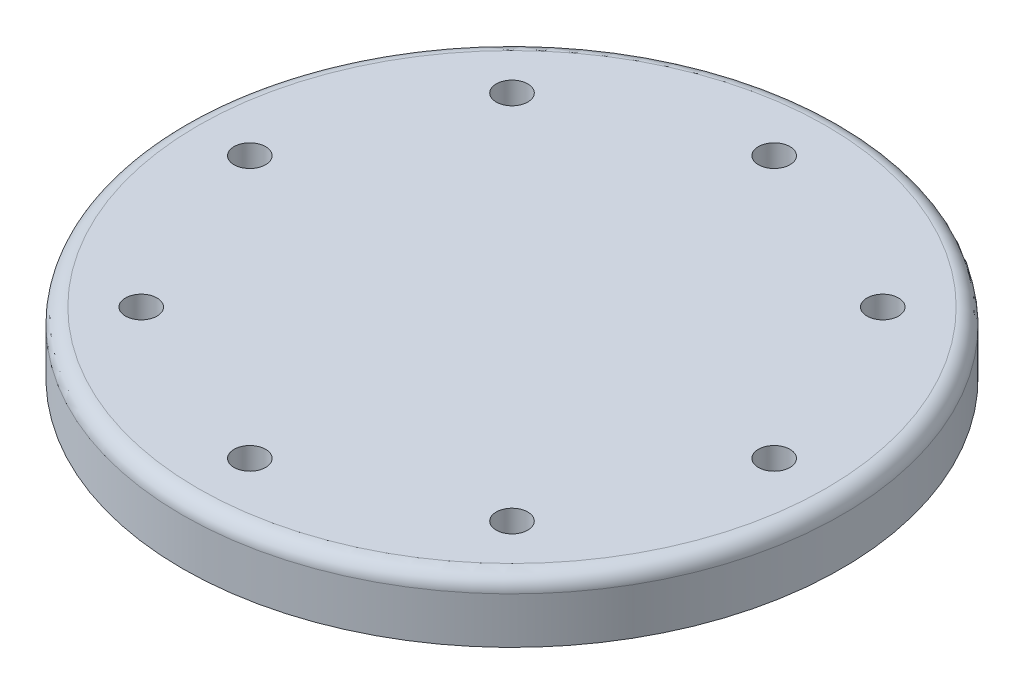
ISO-10303-21;
HEADER;
FILE_DESCRIPTION(('STEP AP214'),'2;1');
FILE_NAME('part.step','',(''),(''),'','','');
FILE_SCHEMA(('AUTOMOTIVE_DESIGN { 1 0 10303 214 1 1 1 1 }'));
ENDSEC;
DATA;
#1=APPLICATION_CONTEXT('core data for automotive mechanical design processes');
#2=APPLICATION_PROTOCOL_DEFINITION('international standard','automotive_design',2000,#1);
#3=PRODUCT_CONTEXT('',#1,'mechanical');
#4=PRODUCT('Part','Part','',(#3));
#5=PRODUCT_RELATED_PRODUCT_CATEGORY('part','',(#4));
#6=PRODUCT_DEFINITION_FORMATION('','',#4);
#7=PRODUCT_DEFINITION_CONTEXT('part definition',#1,'design');
#8=PRODUCT_DEFINITION('design','',#6,#7);
#9=PRODUCT_DEFINITION_SHAPE('','',#8);
#10=(LENGTH_UNIT() NAMED_UNIT(*) SI_UNIT(.MILLI.,.METRE.));
#11=(NAMED_UNIT(*) PLANE_ANGLE_UNIT() SI_UNIT($,.RADIAN.));
#12=(NAMED_UNIT(*) SI_UNIT($,.STERADIAN.) SOLID_ANGLE_UNIT());
#13=UNCERTAINTY_MEASURE_WITH_UNIT(LENGTH_MEASURE(1.E-05),#10,'distance_accuracy_value','');
#14=(GEOMETRIC_REPRESENTATION_CONTEXT(3) GLOBAL_UNCERTAINTY_ASSIGNED_CONTEXT((#13)) GLOBAL_UNIT_ASSIGNED_CONTEXT((#10,
#11,#12)) REPRESENTATION_CONTEXT('',''));
#15=CARTESIAN_POINT('',(0.,0.,0.));
#16=DIRECTION('',(0.,0.,1.));
#17=DIRECTION('',(1.,0.,0.));
#18=AXIS2_PLACEMENT_3D('',#15,#16,#17);
#19=CARTESIAN_POINT('',(-28.575,9.525,-28.575));
#20=DIRECTION('',(0.,-1.,0.));
#21=DIRECTION('',(0.,0.,-1.));
#22=AXIS2_PLACEMENT_3D('',#19,#20,#21);
#23=CYLINDRICAL_SURFACE('',#22,2.43125);
#24=CARTESIAN_POINT('',(-28.575,9.525,-28.575));
#25=DIRECTION('',(0.,1.,0.));
#26=DIRECTION('',(0.,0.,1.));
#27=AXIS2_PLACEMENT_3D('',#24,#25,#26);
#28=CIRCLE('',#27,2.43125);
#29=CARTESIAN_POINT('',(-28.575,9.525,-31.00625));
#30=VERTEX_POINT('',#29);
#31=EDGE_CURVE('E58',#30,#30,#28,.T.);
#32=CARTESIAN_POINT('',(-28.575,4.7625,-28.575));
#33=DIRECTION('',(0.,-1.,0.));
#34=DIRECTION('',(0.,0.,-1.));
#35=AXIS2_PLACEMENT_3D('',#32,#33,#34);
#36=CIRCLE('',#35,2.43125);
#37=CARTESIAN_POINT('',(-28.575,4.7625,-31.00625));
#38=VERTEX_POINT('',#37);
#39=EDGE_CURVE('E61',#38,#38,#36,.T.);
#40=CARTESIAN_POINT('',(-28.575,9.525,-31.00625));
#41=CARTESIAN_POINT('',(-28.575,9.475390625,-31.00625));
#42=CARTESIAN_POINT('',(-28.575,9.42578125,-31.00625));
#43=CARTESIAN_POINT('',(-28.575,9.3265625,-31.00625));
#44=CARTESIAN_POINT('',(-28.575,9.276953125,-31.00625));
#45=CARTESIAN_POINT('',(-28.575,9.177734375,-31.00625));
#46=CARTESIAN_POINT('',(-28.575,9.128125,-31.00625));
#47=CARTESIAN_POINT('',(-28.575,9.02890625,-31.00625));
#48=CARTESIAN_POINT('',(-28.575,8.979296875,-31.00625));
#49=CARTESIAN_POINT('',(-28.575,8.880078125,-31.00625));
#50=CARTESIAN_POINT('',(-28.575,8.83046875,-31.00625));
#51=CARTESIAN_POINT('',(-28.575,8.73125,-31.00625));
#52=CARTESIAN_POINT('',(-28.575,8.681640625,-31.00625));
#53=CARTESIAN_POINT('',(-28.575,8.582421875,-31.00625));
#54=CARTESIAN_POINT('',(-28.575,8.5328125,-31.00625));
#55=CARTESIAN_POINT('',(-28.575,8.43359375,-31.00625));
#56=CARTESIAN_POINT('',(-28.575,8.383984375,-31.00625));
#57=CARTESIAN_POINT('',(-28.575,8.284765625,-31.00625));
#58=CARTESIAN_POINT('',(-28.575,8.23515625,-31.00625));
#59=CARTESIAN_POINT('',(-28.575,8.1359375,-31.00625));
#60=CARTESIAN_POINT('',(-28.575,8.086328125,-31.00625));
#61=CARTESIAN_POINT('',(-28.575,7.987109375,-31.00625));
#62=CARTESIAN_POINT('',(-28.575,7.9375,-31.00625));
#63=CARTESIAN_POINT('',(-28.575,7.83828125,-31.00625));
#64=CARTESIAN_POINT('',(-28.575,7.788671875,-31.00625));
#65=CARTESIAN_POINT('',(-28.575,7.689453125,-31.00625));
#66=CARTESIAN_POINT('',(-28.575,7.63984375,-31.00625));
#67=CARTESIAN_POINT('',(-28.575,7.540625,-31.00625));
#68=CARTESIAN_POINT('',(-28.575,7.491015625,-31.00625));
#69=CARTESIAN_POINT('',(-28.575,7.391796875,-31.00625));
#70=CARTESIAN_POINT('',(-28.575,7.3421875,-31.00625));
#71=CARTESIAN_POINT('',(-28.575,7.24296875,-31.00625));
#72=CARTESIAN_POINT('',(-28.575,7.193359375,-31.00625));
#73=CARTESIAN_POINT('',(-28.575,7.094140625,-31.00625));
#74=CARTESIAN_POINT('',(-28.575,7.04453125,-31.00625));
#75=CARTESIAN_POINT('',(-28.575,6.9453125,-31.00625));
#76=CARTESIAN_POINT('',(-28.575,6.895703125,-31.00625));
#77=CARTESIAN_POINT('',(-28.575,6.796484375,-31.00625));
#78=CARTESIAN_POINT('',(-28.575,6.746875,-31.00625));
#79=CARTESIAN_POINT('',(-28.575,6.64765625,-31.00625));
#80=CARTESIAN_POINT('',(-28.575,6.598046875,-31.00625));
#81=CARTESIAN_POINT('',(-28.575,6.498828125,-31.00625));
#82=CARTESIAN_POINT('',(-28.575,6.44921875,-31.00625));
#83=CARTESIAN_POINT('',(-28.575,6.35,-31.00625));
#84=CARTESIAN_POINT('',(-28.575,6.300390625,-31.00625));
#85=CARTESIAN_POINT('',(-28.575,6.201171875,-31.00625));
#86=CARTESIAN_POINT('',(-28.575,6.1515625,-31.00625));
#87=CARTESIAN_POINT('',(-28.575,6.05234375,-31.00625));
#88=CARTESIAN_POINT('',(-28.575,6.002734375,-31.00625));
#89=CARTESIAN_POINT('',(-28.575,5.903515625,-31.00625));
#90=CARTESIAN_POINT('',(-28.575,5.85390625,-31.00625));
#91=CARTESIAN_POINT('',(-28.575,5.7546875,-31.00625));
#92=CARTESIAN_POINT('',(-28.575,5.705078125,-31.00625));
#93=CARTESIAN_POINT('',(-28.575,5.605859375,-31.00625));
#94=CARTESIAN_POINT('',(-28.575,5.55625,-31.00625));
#95=CARTESIAN_POINT('',(-28.575,5.45703125,-31.00625));
#96=CARTESIAN_POINT('',(-28.575,5.407421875,-31.00625));
#97=CARTESIAN_POINT('',(-28.575,5.308203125,-31.00625));
#98=CARTESIAN_POINT('',(-28.575,5.25859375,-31.00625));
#99=CARTESIAN_POINT('',(-28.575,5.159375,-31.00625));
#100=CARTESIAN_POINT('',(-28.575,5.109765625,-31.00625));
#101=CARTESIAN_POINT('',(-28.575,5.010546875,-31.00625));
#102=CARTESIAN_POINT('',(-28.575,4.9609375,-31.00625));
#103=CARTESIAN_POINT('',(-28.575,4.86171875,-31.00625));
#104=CARTESIAN_POINT('',(-28.575,4.812109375,-31.00625));
#105=CARTESIAN_POINT('',(-28.575,4.7625,-31.00625));
#106=B_SPLINE_CURVE_WITH_KNOTS('',3,(#40,#41,#42,#43,#44,#45,#46,#47,#48,#49,#50,#51,#52,#53,
#54,#55,#56,#57,#58,#59,#60,#61,#62,#63,#64,#65,#66,#67,#68,#69,#70,#71,#72,#73,#74,#75,#76,#77,
#78,#79,#80,#81,#82,#83,#84,#85,#86,#87,#88,#89,#90,#91,#92,#93,#94,#95,#96,#97,#98,#99,#100,
#101,#102,#103,#104,#105),.UNSPECIFIED.,.F.,.F.,(4,2,2,2,2,2,2,2,2,2,2,2,2,2,2,2,2,2,2,2,2,2,2,
2,2,2,2,2,2,2,2,2,4),(0.,0.148828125,0.29765625,0.446484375,0.5953125,0.744140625,
0.892968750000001,1.041796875,1.190625,1.339453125,1.48828125,1.637109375,1.7859375,1.934765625,
2.08359375,2.232421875,2.38125,2.530078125,2.67890625,2.827734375,2.9765625,3.125390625,
3.27421875,3.423046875,3.571875,3.720703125,3.86953125,4.018359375,4.1671875,4.316015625,
4.46484375,4.613671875,4.7625),.UNSPECIFIED.);
#107=EDGE_CURVE('BSEAM40',#30,#38,#106,.T.);
#108=ORIENTED_EDGE('',*,*,#31,.T.);
#109=ORIENTED_EDGE('',*,*,#39,.T.);
#110=ORIENTED_EDGE('',*,*,#107,.T.);
#111=ORIENTED_EDGE('',*,*,#107,.F.);
#112=EDGE_LOOP('',(#108,#110,#109,#111));
#113=FACE_BOUND('',#112,.T.);
#114=ADVANCED_FACE('F40',(#113),#23,.F.);
#115=CARTESIAN_POINT('',(-28.575,9.525,28.575));
#116=DIRECTION('',(0.,-1.,0.));
#117=DIRECTION('',(0.,0.,-1.));
#118=AXIS2_PLACEMENT_3D('',#115,#116,#117);
#119=CYLINDRICAL_SURFACE('',#118,2.43125);
#120=CARTESIAN_POINT('',(-28.575,9.525,28.575));
#121=DIRECTION('',(0.,1.,0.));
#122=DIRECTION('',(0.,0.,1.));
#123=AXIS2_PLACEMENT_3D('',#120,#121,#122);
#124=CIRCLE('',#123,2.43125);
#125=CARTESIAN_POINT('',(-28.575,9.525,26.14375));
#126=VERTEX_POINT('',#125);
#127=EDGE_CURVE('E82',#126,#126,#124,.T.);
#128=CARTESIAN_POINT('',(-28.575,4.7625,28.575));
#129=DIRECTION('',(0.,-1.,0.));
#130=DIRECTION('',(0.,0.,-1.));
#131=AXIS2_PLACEMENT_3D('',#128,#129,#130);
#132=CIRCLE('',#131,2.43125);
#133=CARTESIAN_POINT('',(-28.575,4.7625,26.14375));
#134=VERTEX_POINT('',#133);
#135=EDGE_CURVE('E66',#134,#134,#132,.T.);
#136=CARTESIAN_POINT('',(-28.575,9.525,26.14375));
#137=CARTESIAN_POINT('',(-28.575,9.475390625,26.14375));
#138=CARTESIAN_POINT('',(-28.575,9.42578125,26.14375));
#139=CARTESIAN_POINT('',(-28.575,9.3265625,26.14375));
#140=CARTESIAN_POINT('',(-28.575,9.276953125,26.14375));
#141=CARTESIAN_POINT('',(-28.575,9.177734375,26.14375));
#142=CARTESIAN_POINT('',(-28.575,9.128125,26.14375));
#143=CARTESIAN_POINT('',(-28.575,9.02890625,26.14375));
#144=CARTESIAN_POINT('',(-28.575,8.979296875,26.14375));
#145=CARTESIAN_POINT('',(-28.575,8.880078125,26.14375));
#146=CARTESIAN_POINT('',(-28.575,8.83046875,26.14375));
#147=CARTESIAN_POINT('',(-28.575,8.73125,26.14375));
#148=CARTESIAN_POINT('',(-28.575,8.681640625,26.14375));
#149=CARTESIAN_POINT('',(-28.575,8.582421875,26.14375));
#150=CARTESIAN_POINT('',(-28.575,8.5328125,26.14375));
#151=CARTESIAN_POINT('',(-28.575,8.43359375,26.14375));
#152=CARTESIAN_POINT('',(-28.575,8.383984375,26.14375));
#153=CARTESIAN_POINT('',(-28.575,8.284765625,26.14375));
#154=CARTESIAN_POINT('',(-28.575,8.23515625,26.14375));
#155=CARTESIAN_POINT('',(-28.575,8.1359375,26.14375));
#156=CARTESIAN_POINT('',(-28.575,8.086328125,26.14375));
#157=CARTESIAN_POINT('',(-28.575,7.987109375,26.14375));
#158=CARTESIAN_POINT('',(-28.575,7.9375,26.14375));
#159=CARTESIAN_POINT('',(-28.575,7.83828125,26.14375));
#160=CARTESIAN_POINT('',(-28.575,7.788671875,26.14375));
#161=CARTESIAN_POINT('',(-28.575,7.689453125,26.14375));
#162=CARTESIAN_POINT('',(-28.575,7.63984375,26.14375));
#163=CARTESIAN_POINT('',(-28.575,7.540625,26.14375));
#164=CARTESIAN_POINT('',(-28.575,7.491015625,26.14375));
#165=CARTESIAN_POINT('',(-28.575,7.391796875,26.14375));
#166=CARTESIAN_POINT('',(-28.575,7.3421875,26.14375));
#167=CARTESIAN_POINT('',(-28.575,7.24296875,26.14375));
#168=CARTESIAN_POINT('',(-28.575,7.193359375,26.14375));
#169=CARTESIAN_POINT('',(-28.575,7.094140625,26.14375));
#170=CARTESIAN_POINT('',(-28.575,7.04453125,26.14375));
#171=CARTESIAN_POINT('',(-28.575,6.9453125,26.14375));
#172=CARTESIAN_POINT('',(-28.575,6.895703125,26.14375));
#173=CARTESIAN_POINT('',(-28.575,6.796484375,26.14375));
#174=CARTESIAN_POINT('',(-28.575,6.746875,26.14375));
#175=CARTESIAN_POINT('',(-28.575,6.64765625,26.14375));
#176=CARTESIAN_POINT('',(-28.575,6.598046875,26.14375));
#177=CARTESIAN_POINT('',(-28.575,6.498828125,26.14375));
#178=CARTESIAN_POINT('',(-28.575,6.44921875,26.14375));
#179=CARTESIAN_POINT('',(-28.575,6.35,26.14375));
#180=CARTESIAN_POINT('',(-28.575,6.300390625,26.14375));
#181=CARTESIAN_POINT('',(-28.575,6.201171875,26.14375));
#182=CARTESIAN_POINT('',(-28.575,6.1515625,26.14375));
#183=CARTESIAN_POINT('',(-28.575,6.05234375,26.14375));
#184=CARTESIAN_POINT('',(-28.575,6.002734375,26.14375));
#185=CARTESIAN_POINT('',(-28.575,5.903515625,26.14375));
#186=CARTESIAN_POINT('',(-28.575,5.85390625,26.14375));
#187=CARTESIAN_POINT('',(-28.575,5.7546875,26.14375));
#188=CARTESIAN_POINT('',(-28.575,5.705078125,26.14375));
#189=CARTESIAN_POINT('',(-28.575,5.605859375,26.14375));
#190=CARTESIAN_POINT('',(-28.575,5.55625,26.14375));
#191=CARTESIAN_POINT('',(-28.575,5.45703125,26.14375));
#192=CARTESIAN_POINT('',(-28.575,5.407421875,26.14375));
#193=CARTESIAN_POINT('',(-28.575,5.308203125,26.14375));
#194=CARTESIAN_POINT('',(-28.575,5.25859375,26.14375));
#195=CARTESIAN_POINT('',(-28.575,5.159375,26.14375));
#196=CARTESIAN_POINT('',(-28.575,5.109765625,26.14375));
#197=CARTESIAN_POINT('',(-28.575,5.010546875,26.14375));
#198=CARTESIAN_POINT('',(-28.575,4.9609375,26.14375));
#199=CARTESIAN_POINT('',(-28.575,4.86171875,26.14375));
#200=CARTESIAN_POINT('',(-28.575,4.812109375,26.14375));
#201=CARTESIAN_POINT('',(-28.575,4.7625,26.14375));
#202=B_SPLINE_CURVE_WITH_KNOTS('',3,(#136,#137,#138,#139,#140,#141,#142,#143,#144,#145,#146,
#147,#148,#149,#150,#151,#152,#153,#154,#155,#156,#157,#158,#159,#160,#161,#162,#163,#164,#165,
#166,#167,#168,#169,#170,#171,#172,#173,#174,#175,#176,#177,#178,#179,#180,#181,#182,#183,#184,
#185,#186,#187,#188,#189,#190,#191,#192,#193,#194,#195,#196,#197,#198,#199,#200,#201),
.UNSPECIFIED.,.F.,.F.,(4,2,2,2,2,2,2,2,2,2,2,2,2,2,2,2,2,2,2,2,2,2,2,2,2,2,2,2,2,2,2,2,4),(0.,
0.148828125,0.29765625,0.446484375,0.5953125,0.744140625,0.892968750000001,1.041796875,1.190625,
1.339453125,1.48828125,1.637109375,1.7859375,1.934765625,2.08359375,2.232421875,2.38125,
2.530078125,2.67890625,2.827734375,2.9765625,3.125390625,3.27421875,3.423046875,3.571875,
3.720703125,3.86953125,4.018359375,4.1671875,4.316015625,4.46484375,4.613671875,4.7625),.UNSPECIFIED.);
#203=EDGE_CURVE('BSEAM195',#126,#134,#202,.T.);
#204=ORIENTED_EDGE('',*,*,#127,.T.);
#205=ORIENTED_EDGE('',*,*,#135,.T.);
#206=ORIENTED_EDGE('',*,*,#203,.T.);
#207=ORIENTED_EDGE('',*,*,#203,.F.);
#208=EDGE_LOOP('',(#204,#206,#205,#207));
#209=FACE_BOUND('',#208,.T.);
#210=ADVANCED_FACE('F195',(#209),#119,.F.);
#211=CARTESIAN_POINT('',(28.575,9.525,28.575));
#212=DIRECTION('',(0.,-1.,0.));
#213=DIRECTION('',(0.,0.,-1.));
#214=AXIS2_PLACEMENT_3D('',#211,#212,#213);
#215=CYLINDRICAL_SURFACE('',#214,2.43125);
#216=CARTESIAN_POINT('',(28.575,9.525,28.575));
#217=DIRECTION('',(0.,1.,0.));
#218=DIRECTION('',(0.,0.,1.));
#219=AXIS2_PLACEMENT_3D('',#216,#217,#218);
#220=CIRCLE('',#219,2.43125);
#221=CARTESIAN_POINT('',(28.575,9.525,26.14375));
#222=VERTEX_POINT('',#221);
#223=EDGE_CURVE('E86',#222,#222,#220,.T.);
#224=CARTESIAN_POINT('',(28.575,4.7625,28.575));
#225=DIRECTION('',(0.,-1.,0.));
#226=DIRECTION('',(0.,0.,-1.));
#227=AXIS2_PLACEMENT_3D('',#224,#225,#226);
#228=CIRCLE('',#227,2.43125);
#229=CARTESIAN_POINT('',(28.575,4.7625,26.14375));
#230=VERTEX_POINT('',#229);
#231=EDGE_CURVE('E70',#230,#230,#228,.T.);
#232=CARTESIAN_POINT('',(28.575,9.525,26.14375));
#233=CARTESIAN_POINT('',(28.575,9.475390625,26.14375));
#234=CARTESIAN_POINT('',(28.575,9.42578125,26.14375));
#235=CARTESIAN_POINT('',(28.575,9.3265625,26.14375));
#236=CARTESIAN_POINT('',(28.575,9.276953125,26.14375));
#237=CARTESIAN_POINT('',(28.575,9.177734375,26.14375));
#238=CARTESIAN_POINT('',(28.575,9.128125,26.14375));
#239=CARTESIAN_POINT('',(28.575,9.02890625,26.14375));
#240=CARTESIAN_POINT('',(28.575,8.979296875,26.14375));
#241=CARTESIAN_POINT('',(28.575,8.880078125,26.14375));
#242=CARTESIAN_POINT('',(28.575,8.83046875,26.14375));
#243=CARTESIAN_POINT('',(28.575,8.73125,26.14375));
#244=CARTESIAN_POINT('',(28.575,8.681640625,26.14375));
#245=CARTESIAN_POINT('',(28.575,8.582421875,26.14375));
#246=CARTESIAN_POINT('',(28.575,8.5328125,26.14375));
#247=CARTESIAN_POINT('',(28.575,8.43359375,26.14375));
#248=CARTESIAN_POINT('',(28.575,8.383984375,26.14375));
#249=CARTESIAN_POINT('',(28.575,8.284765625,26.14375));
#250=CARTESIAN_POINT('',(28.575,8.23515625,26.14375));
#251=CARTESIAN_POINT('',(28.575,8.1359375,26.14375));
#252=CARTESIAN_POINT('',(28.575,8.086328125,26.14375));
#253=CARTESIAN_POINT('',(28.575,7.987109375,26.14375));
#254=CARTESIAN_POINT('',(28.575,7.9375,26.14375));
#255=CARTESIAN_POINT('',(28.575,7.83828125,26.14375));
#256=CARTESIAN_POINT('',(28.575,7.788671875,26.14375));
#257=CARTESIAN_POINT('',(28.575,7.689453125,26.14375));
#258=CARTESIAN_POINT('',(28.575,7.63984375,26.14375));
#259=CARTESIAN_POINT('',(28.575,7.540625,26.14375));
#260=CARTESIAN_POINT('',(28.575,7.491015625,26.14375));
#261=CARTESIAN_POINT('',(28.575,7.391796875,26.14375));
#262=CARTESIAN_POINT('',(28.575,7.3421875,26.14375));
#263=CARTESIAN_POINT('',(28.575,7.24296875,26.14375));
#264=CARTESIAN_POINT('',(28.575,7.193359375,26.14375));
#265=CARTESIAN_POINT('',(28.575,7.094140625,26.14375));
#266=CARTESIAN_POINT('',(28.575,7.04453125,26.14375));
#267=CARTESIAN_POINT('',(28.575,6.9453125,26.14375));
#268=CARTESIAN_POINT('',(28.575,6.895703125,26.14375));
#269=CARTESIAN_POINT('',(28.575,6.796484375,26.14375));
#270=CARTESIAN_POINT('',(28.575,6.746875,26.14375));
#271=CARTESIAN_POINT('',(28.575,6.64765625,26.14375));
#272=CARTESIAN_POINT('',(28.575,6.598046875,26.14375));
#273=CARTESIAN_POINT('',(28.575,6.498828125,26.14375));
#274=CARTESIAN_POINT('',(28.575,6.44921875,26.14375));
#275=CARTESIAN_POINT('',(28.575,6.35,26.14375));
#276=CARTESIAN_POINT('',(28.575,6.300390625,26.14375));
#277=CARTESIAN_POINT('',(28.575,6.201171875,26.14375));
#278=CARTESIAN_POINT('',(28.575,6.1515625,26.14375));
#279=CARTESIAN_POINT('',(28.575,6.05234375,26.14375));
#280=CARTESIAN_POINT('',(28.575,6.002734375,26.14375));
#281=CARTESIAN_POINT('',(28.575,5.903515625,26.14375));
#282=CARTESIAN_POINT('',(28.575,5.85390625,26.14375));
#283=CARTESIAN_POINT('',(28.575,5.7546875,26.14375));
#284=CARTESIAN_POINT('',(28.575,5.705078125,26.14375));
#285=CARTESIAN_POINT('',(28.575,5.605859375,26.14375));
#286=CARTESIAN_POINT('',(28.575,5.55625,26.14375));
#287=CARTESIAN_POINT('',(28.575,5.45703125,26.14375));
#288=CARTESIAN_POINT('',(28.575,5.407421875,26.14375));
#289=CARTESIAN_POINT('',(28.575,5.308203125,26.14375));
#290=CARTESIAN_POINT('',(28.575,5.25859375,26.14375));
#291=CARTESIAN_POINT('',(28.575,5.159375,26.14375));
#292=CARTESIAN_POINT('',(28.575,5.109765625,26.14375));
#293=CARTESIAN_POINT('',(28.575,5.010546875,26.14375));
#294=CARTESIAN_POINT('',(28.575,4.9609375,26.14375));
#295=CARTESIAN_POINT('',(28.575,4.86171875,26.14375));
#296=CARTESIAN_POINT('',(28.575,4.812109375,26.14375));
#297=CARTESIAN_POINT('',(28.575,4.7625,26.14375));
#298=B_SPLINE_CURVE_WITH_KNOTS('',3,(#232,#233,#234,#235,#236,#237,#238,#239,#240,#241,#242,
#243,#244,#245,#246,#247,#248,#249,#250,#251,#252,#253,#254,#255,#256,#257,#258,#259,#260,#261,
#262,#263,#264,#265,#266,#267,#268,#269,#270,#271,#272,#273,#274,#275,#276,#277,#278,#279,#280,
#281,#282,#283,#284,#285,#286,#287,#288,#289,#290,#291,#292,#293,#294,#295,#296,#297),
.UNSPECIFIED.,.F.,.F.,(4,2,2,2,2,2,2,2,2,2,2,2,2,2,2,2,2,2,2,2,2,2,2,2,2,2,2,2,2,2,2,2,4),(0.,
0.148828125,0.29765625,0.446484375,0.5953125,0.744140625,0.892968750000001,1.041796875,1.190625,
1.339453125,1.48828125,1.637109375,1.7859375,1.934765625,2.08359375,2.232421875,2.38125,
2.530078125,2.67890625,2.827734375,2.9765625,3.125390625,3.27421875,3.423046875,3.571875,
3.720703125,3.86953125,4.018359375,4.1671875,4.316015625,4.46484375,4.613671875,4.7625),.UNSPECIFIED.);
#299=EDGE_CURVE('BSEAM201',#222,#230,#298,.T.);
#300=ORIENTED_EDGE('',*,*,#223,.T.);
#301=ORIENTED_EDGE('',*,*,#231,.T.);
#302=ORIENTED_EDGE('',*,*,#299,.T.);
#303=ORIENTED_EDGE('',*,*,#299,.F.);
#304=EDGE_LOOP('',(#300,#302,#301,#303));
#305=FACE_BOUND('',#304,.T.);
#306=ADVANCED_FACE('F201',(#305),#215,.F.);
#307=CARTESIAN_POINT('',(28.575,9.525,-28.575));
#308=DIRECTION('',(0.,-1.,0.));
#309=DIRECTION('',(0.,0.,-1.));
#310=AXIS2_PLACEMENT_3D('',#307,#308,#309);
#311=CYLINDRICAL_SURFACE('',#310,2.43125);
#312=CARTESIAN_POINT('',(28.575,9.525,-28.575));
#313=DIRECTION('',(0.,1.,0.));
#314=DIRECTION('',(0.,0.,1.));
#315=AXIS2_PLACEMENT_3D('',#312,#313,#314);
#316=CIRCLE('',#315,2.43125);
#317=CARTESIAN_POINT('',(28.575,9.525,-31.00625));
#318=VERTEX_POINT('',#317);
#319=EDGE_CURVE('E90',#318,#318,#316,.T.);
#320=CARTESIAN_POINT('',(28.575,4.7625,-28.575));
#321=DIRECTION('',(0.,-1.,0.));
#322=DIRECTION('',(0.,0.,-1.));
#323=AXIS2_PLACEMENT_3D('',#320,#321,#322);
#324=CIRCLE('',#323,2.43125);
#325=CARTESIAN_POINT('',(28.575,4.7625,-31.00625));
#326=VERTEX_POINT('',#325);
#327=EDGE_CURVE('E74',#326,#326,#324,.T.);
#328=CARTESIAN_POINT('',(28.575,9.525,-31.00625));
#329=CARTESIAN_POINT('',(28.575,9.475390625,-31.00625));
#330=CARTESIAN_POINT('',(28.575,9.42578125,-31.00625));
#331=CARTESIAN_POINT('',(28.575,9.3265625,-31.00625));
#332=CARTESIAN_POINT('',(28.575,9.276953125,-31.00625));
#333=CARTESIAN_POINT('',(28.575,9.177734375,-31.00625));
#334=CARTESIAN_POINT('',(28.575,9.128125,-31.00625));
#335=CARTESIAN_POINT('',(28.575,9.02890625,-31.00625));
#336=CARTESIAN_POINT('',(28.575,8.979296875,-31.00625));
#337=CARTESIAN_POINT('',(28.575,8.880078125,-31.00625));
#338=CARTESIAN_POINT('',(28.575,8.83046875,-31.00625));
#339=CARTESIAN_POINT('',(28.575,8.73125,-31.00625));
#340=CARTESIAN_POINT('',(28.575,8.681640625,-31.00625));
#341=CARTESIAN_POINT('',(28.575,8.582421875,-31.00625));
#342=CARTESIAN_POINT('',(28.575,8.5328125,-31.00625));
#343=CARTESIAN_POINT('',(28.575,8.43359375,-31.00625));
#344=CARTESIAN_POINT('',(28.575,8.383984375,-31.00625));
#345=CARTESIAN_POINT('',(28.575,8.284765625,-31.00625));
#346=CARTESIAN_POINT('',(28.575,8.23515625,-31.00625));
#347=CARTESIAN_POINT('',(28.575,8.1359375,-31.00625));
#348=CARTESIAN_POINT('',(28.575,8.086328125,-31.00625));
#349=CARTESIAN_POINT('',(28.575,7.987109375,-31.00625));
#350=CARTESIAN_POINT('',(28.575,7.9375,-31.00625));
#351=CARTESIAN_POINT('',(28.575,7.83828125,-31.00625));
#352=CARTESIAN_POINT('',(28.575,7.788671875,-31.00625));
#353=CARTESIAN_POINT('',(28.575,7.689453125,-31.00625));
#354=CARTESIAN_POINT('',(28.575,7.63984375,-31.00625));
#355=CARTESIAN_POINT('',(28.575,7.540625,-31.00625));
#356=CARTESIAN_POINT('',(28.575,7.491015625,-31.00625));
#357=CARTESIAN_POINT('',(28.575,7.391796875,-31.00625));
#358=CARTESIAN_POINT('',(28.575,7.3421875,-31.00625));
#359=CARTESIAN_POINT('',(28.575,7.24296875,-31.00625));
#360=CARTESIAN_POINT('',(28.575,7.193359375,-31.00625));
#361=CARTESIAN_POINT('',(28.575,7.094140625,-31.00625));
#362=CARTESIAN_POINT('',(28.575,7.04453125,-31.00625));
#363=CARTESIAN_POINT('',(28.575,6.9453125,-31.00625));
#364=CARTESIAN_POINT('',(28.575,6.895703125,-31.00625));
#365=CARTESIAN_POINT('',(28.575,6.796484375,-31.00625));
#366=CARTESIAN_POINT('',(28.575,6.746875,-31.00625));
#367=CARTESIAN_POINT('',(28.575,6.64765625,-31.00625));
#368=CARTESIAN_POINT('',(28.575,6.598046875,-31.00625));
#369=CARTESIAN_POINT('',(28.575,6.498828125,-31.00625));
#370=CARTESIAN_POINT('',(28.575,6.44921875,-31.00625));
#371=CARTESIAN_POINT('',(28.575,6.35,-31.00625));
#372=CARTESIAN_POINT('',(28.575,6.300390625,-31.00625));
#373=CARTESIAN_POINT('',(28.575,6.201171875,-31.00625));
#374=CARTESIAN_POINT('',(28.575,6.1515625,-31.00625));
#375=CARTESIAN_POINT('',(28.575,6.05234375,-31.00625));
#376=CARTESIAN_POINT('',(28.575,6.002734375,-31.00625));
#377=CARTESIAN_POINT('',(28.575,5.903515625,-31.00625));
#378=CARTESIAN_POINT('',(28.575,5.85390625,-31.00625));
#379=CARTESIAN_POINT('',(28.575,5.7546875,-31.00625));
#380=CARTESIAN_POINT('',(28.575,5.705078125,-31.00625));
#381=CARTESIAN_POINT('',(28.575,5.605859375,-31.00625));
#382=CARTESIAN_POINT('',(28.575,5.55625,-31.00625));
#383=CARTESIAN_POINT('',(28.575,5.45703125,-31.00625));
#384=CARTESIAN_POINT('',(28.575,5.407421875,-31.00625));
#385=CARTESIAN_POINT('',(28.575,5.308203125,-31.00625));
#386=CARTESIAN_POINT('',(28.575,5.25859375,-31.00625));
#387=CARTESIAN_POINT('',(28.575,5.159375,-31.00625));
#388=CARTESIAN_POINT('',(28.575,5.109765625,-31.00625));
#389=CARTESIAN_POINT('',(28.575,5.010546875,-31.00625));
#390=CARTESIAN_POINT('',(28.575,4.9609375,-31.00625));
#391=CARTESIAN_POINT('',(28.575,4.86171875,-31.00625));
#392=CARTESIAN_POINT('',(28.575,4.812109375,-31.00625));
#393=CARTESIAN_POINT('',(28.575,4.7625,-31.00625));
#394=B_SPLINE_CURVE_WITH_KNOTS('',3,(#328,#329,#330,#331,#332,#333,#334,#335,#336,#337,#338,
#339,#340,#341,#342,#343,#344,#345,#346,#347,#348,#349,#350,#351,#352,#353,#354,#355,#356,#357,
#358,#359,#360,#361,#362,#363,#364,#365,#366,#367,#368,#369,#370,#371,#372,#373,#374,#375,#376,
#377,#378,#379,#380,#381,#382,#383,#384,#385,#386,#387,#388,#389,#390,#391,#392,#393),
.UNSPECIFIED.,.F.,.F.,(4,2,2,2,2,2,2,2,2,2,2,2,2,2,2,2,2,2,2,2,2,2,2,2,2,2,2,2,2,2,2,2,4),(0.,
0.148828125,0.29765625,0.446484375,0.5953125,0.744140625,0.892968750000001,1.041796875,1.190625,
1.339453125,1.48828125,1.637109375,1.7859375,1.934765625,2.08359375,2.232421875,2.38125,
2.530078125,2.67890625,2.827734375,2.9765625,3.125390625,3.27421875,3.423046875,3.571875,
3.720703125,3.86953125,4.018359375,4.1671875,4.316015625,4.46484375,4.613671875,4.7625),.UNSPECIFIED.);
#395=EDGE_CURVE('BSEAM208',#318,#326,#394,.T.);
#396=ORIENTED_EDGE('',*,*,#319,.T.);
#397=ORIENTED_EDGE('',*,*,#327,.T.);
#398=ORIENTED_EDGE('',*,*,#395,.T.);
#399=ORIENTED_EDGE('',*,*,#395,.F.);
#400=EDGE_LOOP('',(#396,#398,#397,#399));
#401=FACE_BOUND('',#400,.T.);
#402=ADVANCED_FACE('F208',(#401),#311,.F.);
#403=CARTESIAN_POINT('',(0.,9.525,0.));
#404=DIRECTION('',(0.,1.,0.));
#405=DIRECTION('',(0.,0.,1.));
#406=AXIS2_PLACEMENT_3D('',#403,#404,#405);
#407=PLANE('',#406);
#408=CARTESIAN_POINT('',(0.,9.525,0.));
#409=DIRECTION('',(0.,1.,0.));
#410=DIRECTION('',(0.,0.,1.));
#411=AXIS2_PLACEMENT_3D('',#408,#409,#410);
#412=CIRCLE('',#411,48.41875);
#413=CARTESIAN_POINT('',(0.,9.525,48.41875));
#414=VERTEX_POINT('',#413);
#415=EDGE_CURVE('E48',#414,#414,#412,.T.);
#416=ORIENTED_EDGE('',*,*,#415,.T.);
#417=EDGE_LOOP('',(#416));
#418=FACE_BOUND('',#417,.T.);
#419=CARTESIAN_POINT('',(2.08166817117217E-13,9.525,40.4111525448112));
#420=DIRECTION('',(0.,1.,0.));
#421=DIRECTION('',(0.,0.,1.));
#422=AXIS2_PLACEMENT_3D('',#419,#420,#421);
#423=CIRCLE('',#422,2.43125);
#424=CARTESIAN_POINT('',(2.08166817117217E-13,9.525,37.9799025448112));
#425=VERTEX_POINT('',#424);
#426=EDGE_CURVE('E107',#425,#425,#423,.T.);
#427=ORIENTED_EDGE('',*,*,#426,.F.);
#428=EDGE_LOOP('',(#427));
#429=FACE_BOUND('',#428,.T.);
#430=CARTESIAN_POINT('',(0.,9.525,-40.4111525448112));
#431=DIRECTION('',(0.,1.,0.));
#432=DIRECTION('',(0.,0.,1.));
#433=AXIS2_PLACEMENT_3D('',#430,#431,#432);
#434=CIRCLE('',#433,2.43125);
#435=CARTESIAN_POINT('',(0.,9.525,-42.8424025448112));
#436=VERTEX_POINT('',#435);
#437=EDGE_CURVE('E94',#436,#436,#434,.T.);
#438=ORIENTED_EDGE('',*,*,#437,.F.);
#439=EDGE_LOOP('',(#438));
#440=FACE_BOUND('',#439,.T.);
#441=ORIENTED_EDGE('',*,*,#223,.F.);
#442=EDGE_LOOP('',(#441));
#443=FACE_BOUND('',#442,.T.);
#444=ORIENTED_EDGE('',*,*,#31,.F.);
#445=EDGE_LOOP('',(#444));
#446=FACE_BOUND('',#445,.T.);
#447=ORIENTED_EDGE('',*,*,#127,.F.);
#448=EDGE_LOOP('',(#447));
#449=FACE_BOUND('',#448,.T.);
#450=ORIENTED_EDGE('',*,*,#319,.F.);
#451=EDGE_LOOP('',(#450));
#452=FACE_BOUND('',#451,.T.);
#453=CARTESIAN_POINT('',(-40.4111525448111,9.525,0.));
#454=DIRECTION('',(0.,1.,0.));
#455=DIRECTION('',(0.,0.,1.));
#456=AXIS2_PLACEMENT_3D('',#453,#454,#455);
#457=CIRCLE('',#456,2.43125);
#458=CARTESIAN_POINT('',(-40.4111525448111,9.525,-2.43124999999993));
#459=VERTEX_POINT('',#458);
#460=EDGE_CURVE('E99',#459,#459,#457,.T.);
#461=ORIENTED_EDGE('',*,*,#460,.F.);
#462=EDGE_LOOP('',(#461));
#463=FACE_BOUND('',#462,.T.);
#464=CARTESIAN_POINT('',(40.4111525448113,9.525,0.));
#465=DIRECTION('',(0.,1.,0.));
#466=DIRECTION('',(0.,0.,1.));
#467=AXIS2_PLACEMENT_3D('',#464,#465,#466);
#468=CIRCLE('',#467,2.43125);
#469=CARTESIAN_POINT('',(40.4111525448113,9.525,-2.43125000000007));
#470=VERTEX_POINT('',#469);
#471=EDGE_CURVE('E115',#470,#470,#468,.T.);
#472=ORIENTED_EDGE('',*,*,#471,.F.);
#473=EDGE_LOOP('',(#472));
#474=FACE_BOUND('',#473,.T.);
#475=ADVANCED_FACE('F163',(#418,#429,#440,#443,#446,#449,#452,#463,#474),#407,.T.);
#476=CARTESIAN_POINT('',(0.,0.,0.));
#477=DIRECTION('',(0.,1.,0.));
#478=DIRECTION('',(0.,0.,1.));
#479=AXIS2_PLACEMENT_3D('',#476,#477,#478);
#480=PLANE('',#479);
#481=CARTESIAN_POINT('',(28.575,0.,28.575));
#482=DIRECTION('',(0.,-1.,0.));
#483=DIRECTION('',(0.,0.,-1.));
#484=AXIS2_PLACEMENT_3D('',#481,#482,#483);
#485=CIRCLE('',#484,4.7625);
#486=CARTESIAN_POINT('',(28.575,0.,23.8125));
#487=VERTEX_POINT('',#486);
#488=EDGE_CURVE('E129',#487,#487,#485,.T.);
#489=ORIENTED_EDGE('',*,*,#488,.F.);
#490=EDGE_LOOP('',(#489));
#491=FACE_BOUND('',#490,.T.);
#492=CARTESIAN_POINT('',(-28.575,0.,-28.575));
#493=DIRECTION('',(0.,-1.,0.));
#494=DIRECTION('',(0.,0.,-1.));
#495=AXIS2_PLACEMENT_3D('',#492,#493,#494);
#496=CIRCLE('',#495,4.7625);
#497=CARTESIAN_POINT('',(-28.575,0.,-33.3375));
#498=VERTEX_POINT('',#497);
#499=EDGE_CURVE('E137',#498,#498,#496,.T.);
#500=ORIENTED_EDGE('',*,*,#499,.F.);
#501=EDGE_LOOP('',(#500));
#502=FACE_BOUND('',#501,.T.);
#503=CARTESIAN_POINT('',(28.575,0.,-28.575));
#504=DIRECTION('',(0.,-1.,0.));
#505=DIRECTION('',(0.,0.,-1.));
#506=AXIS2_PLACEMENT_3D('',#503,#504,#505);
#507=CIRCLE('',#506,4.7625);
#508=CARTESIAN_POINT('',(28.575,0.,-33.3375));
#509=VERTEX_POINT('',#508);
#510=EDGE_CURVE('E138',#509,#509,#507,.T.);
#511=ORIENTED_EDGE('',*,*,#510,.F.);
#512=EDGE_LOOP('',(#511));
#513=FACE_BOUND('',#512,.T.);
#514=CARTESIAN_POINT('',(-28.575,0.,28.575));
#515=DIRECTION('',(0.,-1.,0.));
#516=DIRECTION('',(0.,0.,-1.));
#517=AXIS2_PLACEMENT_3D('',#514,#515,#516);
#518=CIRCLE('',#517,4.7625);
#519=CARTESIAN_POINT('',(-28.575,0.,23.8125));
#520=VERTEX_POINT('',#519);
#521=EDGE_CURVE('E125',#520,#520,#518,.T.);
#522=ORIENTED_EDGE('',*,*,#521,.F.);
#523=EDGE_LOOP('',(#522));
#524=FACE_BOUND('',#523,.T.);
#525=CARTESIAN_POINT('',(0.,0.,0.));
#526=DIRECTION('',(0.,1.,0.));
#527=DIRECTION('',(0.,0.,1.));
#528=AXIS2_PLACEMENT_3D('',#525,#526,#527);
#529=CIRCLE('',#528,50.8);
#530=CARTESIAN_POINT('',(0.,0.,-50.8));
#531=VERTEX_POINT('',#530);
#532=EDGE_CURVE('E53',#531,#531,#529,.T.);
#533=ORIENTED_EDGE('',*,*,#532,.F.);
#534=EDGE_LOOP('',(#533));
#535=FACE_BOUND('',#534,.T.);
#536=CARTESIAN_POINT('',(0.,0.,-40.4111525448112));
#537=DIRECTION('',(0.,1.,0.));
#538=DIRECTION('',(0.,0.,1.));
#539=AXIS2_PLACEMENT_3D('',#536,#537,#538);
#540=CIRCLE('',#539,2.43125);
#541=CARTESIAN_POINT('',(0.,0.,-42.8424025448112));
#542=VERTEX_POINT('',#541);
#543=EDGE_CURVE('E95',#542,#542,#540,.T.);
#544=ORIENTED_EDGE('',*,*,#543,.T.);
#545=EDGE_LOOP('',(#544));
#546=FACE_BOUND('',#545,.T.);
#547=CARTESIAN_POINT('',(-40.4111525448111,0.,0.));
#548=DIRECTION('',(0.,1.,0.));
#549=DIRECTION('',(0.,0.,1.));
#550=AXIS2_PLACEMENT_3D('',#547,#548,#549);
#551=CIRCLE('',#550,2.43125);
#552=CARTESIAN_POINT('',(-40.4111525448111,0.,-2.43124999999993));
#553=VERTEX_POINT('',#552);
#554=EDGE_CURVE('E103',#553,#553,#551,.T.);
#555=ORIENTED_EDGE('',*,*,#554,.T.);
#556=EDGE_LOOP('',(#555));
#557=FACE_BOUND('',#556,.T.);
#558=CARTESIAN_POINT('',(2.08166817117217E-13,0.,40.4111525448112));
#559=DIRECTION('',(0.,1.,0.));
#560=DIRECTION('',(0.,0.,1.));
#561=AXIS2_PLACEMENT_3D('',#558,#559,#560);
#562=CIRCLE('',#561,2.43125);
#563=CARTESIAN_POINT('',(2.08166817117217E-13,0.,37.9799025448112));
#564=VERTEX_POINT('',#563);
#565=EDGE_CURVE('E111',#564,#564,#562,.T.);
#566=ORIENTED_EDGE('',*,*,#565,.T.);
#567=EDGE_LOOP('',(#566));
#568=FACE_BOUND('',#567,.T.);
#569=CARTESIAN_POINT('',(40.4111525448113,0.,0.));
#570=DIRECTION('',(0.,1.,0.));
#571=DIRECTION('',(0.,0.,1.));
#572=AXIS2_PLACEMENT_3D('',#569,#570,#571);
#573=CIRCLE('',#572,2.43125);
#574=CARTESIAN_POINT('',(40.4111525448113,0.,-2.43125000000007));
#575=VERTEX_POINT('',#574);
#576=EDGE_CURVE('E65',#575,#575,#573,.T.);
#577=ORIENTED_EDGE('',*,*,#576,.T.);
#578=EDGE_LOOP('',(#577));
#579=FACE_BOUND('',#578,.T.);
#580=ADVANCED_FACE('F159',(#491,#502,#513,#524,#535,#546,#557,#568,#579),#480,.F.);
#581=CARTESIAN_POINT('',(0.,9.525,0.));
#582=DIRECTION('',(0.,-1.,0.));
#583=DIRECTION('',(0.,0.,-1.));
#584=AXIS2_PLACEMENT_3D('',#581,#582,#583);
#585=CYLINDRICAL_SURFACE('',#584,50.8);
#586=CARTESIAN_POINT('',(0.,7.14375,0.));
#587=DIRECTION('',(0.,1.,0.));
#588=DIRECTION('',(0.,0.,1.));
#589=AXIS2_PLACEMENT_3D('',#586,#587,#588);
#590=CIRCLE('',#589,50.8);
#591=CARTESIAN_POINT('',(0.,7.14375,-50.8));
#592=VERTEX_POINT('',#591);
#593=EDGE_CURVE('E10',#592,#592,#590,.F.);
#594=CARTESIAN_POINT('',(0.,7.14375,-50.8));
#595=CARTESIAN_POINT('',(0.,7.0693359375,-50.8));
#596=CARTESIAN_POINT('',(0.,6.994921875,-50.8));
#597=CARTESIAN_POINT('',(0.,6.84609375,-50.8));
#598=CARTESIAN_POINT('',(0.,6.7716796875,-50.8));
#599=CARTESIAN_POINT('',(0.,6.6228515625,-50.8));
#600=CARTESIAN_POINT('',(0.,6.5484375,-50.8));
#601=CARTESIAN_POINT('',(0.,6.399609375,-50.8));
#602=CARTESIAN_POINT('',(0.,6.3251953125,-50.8));
#603=CARTESIAN_POINT('',(0.,6.1763671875,-50.8));
#604=CARTESIAN_POINT('',(0.,6.101953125,-50.8));
#605=CARTESIAN_POINT('',(0.,5.953125,-50.8));
#606=CARTESIAN_POINT('',(0.,5.8787109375,-50.8));
#607=CARTESIAN_POINT('',(0.,5.7298828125,-50.8));
#608=CARTESIAN_POINT('',(0.,5.65546875,-50.8));
#609=CARTESIAN_POINT('',(0.,5.506640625,-50.8));
#610=CARTESIAN_POINT('',(0.,5.4322265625,-50.8));
#611=CARTESIAN_POINT('',(0.,5.2833984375,-50.8));
#612=CARTESIAN_POINT('',(0.,5.208984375,-50.8));
#613=CARTESIAN_POINT('',(0.,5.06015625,-50.8));
#614=CARTESIAN_POINT('',(0.,4.9857421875,-50.8));
#615=CARTESIAN_POINT('',(0.,4.8369140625,-50.8));
#616=CARTESIAN_POINT('',(0.,4.7625,-50.8));
#617=CARTESIAN_POINT('',(0.,4.613671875,-50.8));
#618=CARTESIAN_POINT('',(0.,4.5392578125,-50.8));
#619=CARTESIAN_POINT('',(0.,4.3904296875,-50.8));
#620=CARTESIAN_POINT('',(0.,4.316015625,-50.8));
#621=CARTESIAN_POINT('',(0.,4.1671875,-50.8));
#622=CARTESIAN_POINT('',(0.,4.0927734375,-50.8));
#623=CARTESIAN_POINT('',(0.,3.9439453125,-50.8));
#624=CARTESIAN_POINT('',(0.,3.86953125,-50.8));
#625=CARTESIAN_POINT('',(0.,3.720703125,-50.8));
#626=CARTESIAN_POINT('',(0.,3.6462890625,-50.8));
#627=CARTESIAN_POINT('',(0.,3.4974609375,-50.8));
#628=CARTESIAN_POINT('',(0.,3.423046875,-50.8));
#629=CARTESIAN_POINT('',(0.,3.27421875,-50.8));
#630=CARTESIAN_POINT('',(0.,3.1998046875,-50.8));
#631=CARTESIAN_POINT('',(0.,3.0509765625,-50.8));
#632=CARTESIAN_POINT('',(0.,2.9765625,-50.8));
#633=CARTESIAN_POINT('',(0.,2.827734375,-50.8));
#634=CARTESIAN_POINT('',(0.,2.7533203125,-50.8));
#635=CARTESIAN_POINT('',(0.,2.6044921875,-50.8));
#636=CARTESIAN_POINT('',(0.,2.530078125,-50.8));
#637=CARTESIAN_POINT('',(0.,2.38125,-50.8));
#638=CARTESIAN_POINT('',(0.,2.3068359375,-50.8));
#639=CARTESIAN_POINT('',(0.,2.1580078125,-50.8));
#640=CARTESIAN_POINT('',(0.,2.08359375,-50.8));
#641=CARTESIAN_POINT('',(0.,1.934765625,-50.8));
#642=CARTESIAN_POINT('',(0.,1.8603515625,-50.8));
#643=CARTESIAN_POINT('',(0.,1.7115234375,-50.8));
#644=CARTESIAN_POINT('',(0.,1.637109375,-50.8));
#645=CARTESIAN_POINT('',(0.,1.48828125,-50.8));
#646=CARTESIAN_POINT('',(0.,1.4138671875,-50.8));
#647=CARTESIAN_POINT('',(0.,1.2650390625,-50.8));
#648=CARTESIAN_POINT('',(0.,1.190625,-50.8));
#649=CARTESIAN_POINT('',(0.,1.041796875,-50.8));
#650=CARTESIAN_POINT('',(0.,0.967382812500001,-50.8));
#651=CARTESIAN_POINT('',(0.,0.8185546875,-50.8));
#652=CARTESIAN_POINT('',(0.,0.744140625,-50.8));
#653=CARTESIAN_POINT('',(0.,0.5953125,-50.8));
#654=CARTESIAN_POINT('',(0.,0.5208984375,-50.8));
#655=CARTESIAN_POINT('',(0.,0.3720703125,-50.8));
#656=CARTESIAN_POINT('',(0.,0.29765625,-50.8));
#657=CARTESIAN_POINT('',(0.,0.148828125,-50.8));
#658=CARTESIAN_POINT('',(0.,0.0744140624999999,-50.8));
#659=CARTESIAN_POINT('',(0.,0.,-50.8));
#660=B_SPLINE_CURVE_WITH_KNOTS('',3,(#594,#595,#596,#597,#598,#599,#600,#601,#602,#603,#604,
#605,#606,#607,#608,#609,#610,#611,#612,#613,#614,#615,#616,#617,#618,#619,#620,#621,#622,#623,
#624,#625,#626,#627,#628,#629,#630,#631,#632,#633,#634,#635,#636,#637,#638,#639,#640,#641,#642,
#643,#644,#645,#646,#647,#648,#649,#650,#651,#652,#653,#654,#655,#656,#657,#658,#659),
.UNSPECIFIED.,.F.,.F.,(4,2,2,2,2,2,2,2,2,2,2,2,2,2,2,2,2,2,2,2,2,2,2,2,2,2,2,2,2,2,2,2,4),(0.,
0.2232421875,0.446484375,0.6697265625,0.892968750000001,1.1162109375,1.339453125,1.5626953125,
1.7859375,2.0091796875,2.232421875,2.4556640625,2.67890625,2.9021484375,3.125390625,
3.3486328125,3.571875,3.7951171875,4.018359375,4.2416015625,4.46484375,4.6880859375,4.911328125,
5.1345703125,5.3578125,5.5810546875,5.804296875,6.0275390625,6.25078125,6.4740234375,
6.697265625,6.9205078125,7.14375),.UNSPECIFIED.);
#661=EDGE_CURVE('BSEAM162',#592,#531,#660,.T.);
#662=ORIENTED_EDGE('',*,*,#593,.T.);
#663=ORIENTED_EDGE('',*,*,#532,.T.);
#664=ORIENTED_EDGE('',*,*,#661,.T.);
#665=ORIENTED_EDGE('',*,*,#661,.F.);
#666=EDGE_LOOP('',(#662,#664,#663,#665));
#667=FACE_BOUND('',#666,.T.);
#668=ADVANCED_FACE('F162',(#667),#585,.T.);
#669=CARTESIAN_POINT('',(0.,9.525,-40.4111525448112));
#670=DIRECTION('',(0.,-1.,0.));
#671=DIRECTION('',(0.,0.,-1.));
#672=AXIS2_PLACEMENT_3D('',#669,#670,#671);
#673=CYLINDRICAL_SURFACE('',#672,2.43125);
#674=CARTESIAN_POINT('',(0.,9.525,-42.8424025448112));
#675=CARTESIAN_POINT('',(0.,9.42578125,-42.8424025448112));
#676=CARTESIAN_POINT('',(0.,9.3265625,-42.8424025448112));
#677=CARTESIAN_POINT('',(0.,9.128125,-42.8424025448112));
#678=CARTESIAN_POINT('',(0.,9.02890625,-42.8424025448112));
#679=CARTESIAN_POINT('',(0.,8.83046875,-42.8424025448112));
#680=CARTESIAN_POINT('',(0.,8.73125,-42.8424025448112));
#681=CARTESIAN_POINT('',(0.,8.5328125,-42.8424025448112));
#682=CARTESIAN_POINT('',(0.,8.43359375,-42.8424025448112));
#683=CARTESIAN_POINT('',(0.,8.23515625,-42.8424025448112));
#684=CARTESIAN_POINT('',(0.,8.1359375,-42.8424025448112));
#685=CARTESIAN_POINT('',(0.,7.9375,-42.8424025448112));
#686=CARTESIAN_POINT('',(0.,7.83828125,-42.8424025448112));
#687=CARTESIAN_POINT('',(0.,7.63984375,-42.8424025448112));
#688=CARTESIAN_POINT('',(0.,7.540625,-42.8424025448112));
#689=CARTESIAN_POINT('',(0.,7.3421875,-42.8424025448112));
#690=CARTESIAN_POINT('',(0.,7.24296875,-42.8424025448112));
#691=CARTESIAN_POINT('',(0.,7.04453125,-42.8424025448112));
#692=CARTESIAN_POINT('',(0.,6.9453125,-42.8424025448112));
#693=CARTESIAN_POINT('',(0.,6.746875,-42.8424025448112));
#694=CARTESIAN_POINT('',(0.,6.64765625,-42.8424025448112));
#695=CARTESIAN_POINT('',(0.,6.44921875,-42.8424025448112));
#696=CARTESIAN_POINT('',(0.,6.35,-42.8424025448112));
#697=CARTESIAN_POINT('',(0.,6.1515625,-42.8424025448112));
#698=CARTESIAN_POINT('',(0.,6.05234375,-42.8424025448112));
#699=CARTESIAN_POINT('',(0.,5.85390625,-42.8424025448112));
#700=CARTESIAN_POINT('',(0.,5.7546875,-42.8424025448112));
#701=CARTESIAN_POINT('',(0.,5.55625,-42.8424025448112));
#702=CARTESIAN_POINT('',(0.,5.45703125,-42.8424025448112));
#703=CARTESIAN_POINT('',(0.,5.25859375,-42.8424025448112));
#704=CARTESIAN_POINT('',(0.,5.159375,-42.8424025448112));
#705=CARTESIAN_POINT('',(0.,4.9609375,-42.8424025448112));
#706=CARTESIAN_POINT('',(0.,4.86171875,-42.8424025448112));
#707=CARTESIAN_POINT('',(0.,4.66328125,-42.8424025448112));
#708=CARTESIAN_POINT('',(0.,4.5640625,-42.8424025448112));
#709=CARTESIAN_POINT('',(0.,4.365625,-42.8424025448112));
#710=CARTESIAN_POINT('',(0.,4.26640625,-42.8424025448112));
#711=CARTESIAN_POINT('',(0.,4.06796875,-42.8424025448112));
#712=CARTESIAN_POINT('',(0.,3.96875,-42.8424025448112));
#713=CARTESIAN_POINT('',(0.,3.7703125,-42.8424025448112));
#714=CARTESIAN_POINT('',(0.,3.67109375,-42.8424025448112));
#715=CARTESIAN_POINT('',(0.,3.47265625,-42.8424025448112));
#716=CARTESIAN_POINT('',(0.,3.3734375,-42.8424025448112));
#717=CARTESIAN_POINT('',(0.,3.175,-42.8424025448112));
#718=CARTESIAN_POINT('',(0.,3.07578125,-42.8424025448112));
#719=CARTESIAN_POINT('',(0.,2.87734375,-42.8424025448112));
#720=CARTESIAN_POINT('',(0.,2.778125,-42.8424025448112));
#721=CARTESIAN_POINT('',(0.,2.5796875,-42.8424025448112));
#722=CARTESIAN_POINT('',(0.,2.48046875,-42.8424025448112));
#723=CARTESIAN_POINT('',(0.,2.28203125,-42.8424025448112));
#724=CARTESIAN_POINT('',(0.,2.1828125,-42.8424025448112));
#725=CARTESIAN_POINT('',(0.,1.984375,-42.8424025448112));
#726=CARTESIAN_POINT('',(0.,1.88515625,-42.8424025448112));
#727=CARTESIAN_POINT('',(0.,1.68671875,-42.8424025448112));
#728=CARTESIAN_POINT('',(0.,1.5875,-42.8424025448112));
#729=CARTESIAN_POINT('',(0.,1.3890625,-42.8424025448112));
#730=CARTESIAN_POINT('',(0.,1.28984375,-42.8424025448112));
#731=CARTESIAN_POINT('',(0.,1.09140625,-42.8424025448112));
#732=CARTESIAN_POINT('',(0.,0.992187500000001,-42.8424025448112));
#733=CARTESIAN_POINT('',(0.,0.793750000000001,-42.8424025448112));
#734=CARTESIAN_POINT('',(0.,0.69453125,-42.8424025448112));
#735=CARTESIAN_POINT('',(0.,0.49609375,-42.8424025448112));
#736=CARTESIAN_POINT('',(0.,0.396875,-42.8424025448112));
#737=CARTESIAN_POINT('',(0.,0.1984375,-42.8424025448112));
#738=CARTESIAN_POINT('',(0.,0.0992187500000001,-42.8424025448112));
#739=CARTESIAN_POINT('',(0.,0.,-42.8424025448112));
#740=B_SPLINE_CURVE_WITH_KNOTS('',3,(#674,#675,#676,#677,#678,#679,#680,#681,#682,#683,#684,
#685,#686,#687,#688,#689,#690,#691,#692,#693,#694,#695,#696,#697,#698,#699,#700,#701,#702,#703,
#704,#705,#706,#707,#708,#709,#710,#711,#712,#713,#714,#715,#716,#717,#718,#719,#720,#721,#722,
#723,#724,#725,#726,#727,#728,#729,#730,#731,#732,#733,#734,#735,#736,#737,#738,#739),
.UNSPECIFIED.,.F.,.F.,(4,2,2,2,2,2,2,2,2,2,2,2,2,2,2,2,2,2,2,2,2,2,2,2,2,2,2,2,2,2,2,2,4),(0.,
0.297656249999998,0.595312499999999,0.892968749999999,1.190625,1.48828125,1.7859375,2.08359375,
2.38125,2.67890625,2.9765625,3.27421875,3.571875,3.86953125,4.1671875,4.46484375,4.7625,
5.06015625,5.3578125,5.65546875,5.953125,6.25078125,6.5484375,6.84609375,7.14375,7.44140625,
7.7390625,8.03671875,8.334375,8.63203125,8.9296875,9.22734375,9.525),.UNSPECIFIED.);
#741=EDGE_CURVE('BSEAM210',#436,#542,#740,.T.);
#742=ORIENTED_EDGE('',*,*,#437,.T.);
#743=ORIENTED_EDGE('',*,*,#543,.F.);
#744=ORIENTED_EDGE('',*,*,#741,.T.);
#745=ORIENTED_EDGE('',*,*,#741,.F.);
#746=EDGE_LOOP('',(#742,#744,#743,#745));
#747=FACE_BOUND('',#746,.T.);
#748=ADVANCED_FACE('F210',(#747),#673,.F.);
#749=CARTESIAN_POINT('',(-40.4111525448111,9.525,0.));
#750=DIRECTION('',(0.,-1.,0.));
#751=DIRECTION('',(0.,0.,-1.));
#752=AXIS2_PLACEMENT_3D('',#749,#750,#751);
#753=CYLINDRICAL_SURFACE('',#752,2.43125);
#754=CARTESIAN_POINT('',(-40.4111525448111,9.525,-2.43124999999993));
#755=CARTESIAN_POINT('',(-40.4111525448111,9.42578125,-2.43124999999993));
#756=CARTESIAN_POINT('',(-40.4111525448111,9.3265625,-2.43124999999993));
#757=CARTESIAN_POINT('',(-40.4111525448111,9.128125,-2.43124999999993));
#758=CARTESIAN_POINT('',(-40.4111525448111,9.02890625,-2.43124999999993));
#759=CARTESIAN_POINT('',(-40.4111525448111,8.83046875,-2.43124999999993));
#760=CARTESIAN_POINT('',(-40.4111525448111,8.73125,-2.43124999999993));
#761=CARTESIAN_POINT('',(-40.4111525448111,8.5328125,-2.43124999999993));
#762=CARTESIAN_POINT('',(-40.4111525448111,8.43359375,-2.43124999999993));
#763=CARTESIAN_POINT('',(-40.4111525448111,8.23515625,-2.43124999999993));
#764=CARTESIAN_POINT('',(-40.4111525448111,8.1359375,-2.43124999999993));
#765=CARTESIAN_POINT('',(-40.4111525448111,7.9375,-2.43124999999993));
#766=CARTESIAN_POINT('',(-40.4111525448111,7.83828125,-2.43124999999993));
#767=CARTESIAN_POINT('',(-40.4111525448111,7.63984375,-2.43124999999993));
#768=CARTESIAN_POINT('',(-40.4111525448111,7.540625,-2.43124999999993));
#769=CARTESIAN_POINT('',(-40.4111525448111,7.3421875,-2.43124999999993));
#770=CARTESIAN_POINT('',(-40.4111525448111,7.24296875,-2.43124999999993));
#771=CARTESIAN_POINT('',(-40.4111525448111,7.04453125,-2.43124999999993));
#772=CARTESIAN_POINT('',(-40.4111525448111,6.9453125,-2.43124999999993));
#773=CARTESIAN_POINT('',(-40.4111525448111,6.746875,-2.43124999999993));
#774=CARTESIAN_POINT('',(-40.4111525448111,6.64765625,-2.43124999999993));
#775=CARTESIAN_POINT('',(-40.4111525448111,6.44921875,-2.43124999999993));
#776=CARTESIAN_POINT('',(-40.4111525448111,6.35,-2.43124999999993));
#777=CARTESIAN_POINT('',(-40.4111525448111,6.1515625,-2.43124999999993));
#778=CARTESIAN_POINT('',(-40.4111525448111,6.05234375,-2.43124999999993));
#779=CARTESIAN_POINT('',(-40.4111525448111,5.85390625,-2.43124999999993));
#780=CARTESIAN_POINT('',(-40.4111525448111,5.7546875,-2.43124999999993));
#781=CARTESIAN_POINT('',(-40.4111525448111,5.55625,-2.43124999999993));
#782=CARTESIAN_POINT('',(-40.4111525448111,5.45703125,-2.43124999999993));
#783=CARTESIAN_POINT('',(-40.4111525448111,5.25859375,-2.43124999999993));
#784=CARTESIAN_POINT('',(-40.4111525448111,5.159375,-2.43124999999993));
#785=CARTESIAN_POINT('',(-40.4111525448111,4.9609375,-2.43124999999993));
#786=CARTESIAN_POINT('',(-40.4111525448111,4.86171875,-2.43124999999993));
#787=CARTESIAN_POINT('',(-40.4111525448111,4.66328125,-2.43124999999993));
#788=CARTESIAN_POINT('',(-40.4111525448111,4.5640625,-2.43124999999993));
#789=CARTESIAN_POINT('',(-40.4111525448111,4.365625,-2.43124999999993));
#790=CARTESIAN_POINT('',(-40.4111525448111,4.26640625,-2.43124999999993));
#791=CARTESIAN_POINT('',(-40.4111525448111,4.06796875,-2.43124999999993));
#792=CARTESIAN_POINT('',(-40.4111525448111,3.96875,-2.43124999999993));
#793=CARTESIAN_POINT('',(-40.4111525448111,3.7703125,-2.43124999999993));
#794=CARTESIAN_POINT('',(-40.4111525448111,3.67109375,-2.43124999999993));
#795=CARTESIAN_POINT('',(-40.4111525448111,3.47265625,-2.43124999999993));
#796=CARTESIAN_POINT('',(-40.4111525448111,3.3734375,-2.43124999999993));
#797=CARTESIAN_POINT('',(-40.4111525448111,3.175,-2.43124999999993));
#798=CARTESIAN_POINT('',(-40.4111525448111,3.07578125,-2.43124999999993));
#799=CARTESIAN_POINT('',(-40.4111525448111,2.87734375,-2.43124999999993));
#800=CARTESIAN_POINT('',(-40.4111525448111,2.778125,-2.43124999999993));
#801=CARTESIAN_POINT('',(-40.4111525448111,2.5796875,-2.43124999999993));
#802=CARTESIAN_POINT('',(-40.4111525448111,2.48046875,-2.43124999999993));
#803=CARTESIAN_POINT('',(-40.4111525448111,2.28203125,-2.43124999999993));
#804=CARTESIAN_POINT('',(-40.4111525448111,2.1828125,-2.43124999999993));
#805=CARTESIAN_POINT('',(-40.4111525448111,1.984375,-2.43124999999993));
#806=CARTESIAN_POINT('',(-40.4111525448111,1.88515625,-2.43124999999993));
#807=CARTESIAN_POINT('',(-40.4111525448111,1.68671875,-2.43124999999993));
#808=CARTESIAN_POINT('',(-40.4111525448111,1.5875,-2.43124999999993));
#809=CARTESIAN_POINT('',(-40.4111525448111,1.3890625,-2.43124999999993));
#810=CARTESIAN_POINT('',(-40.4111525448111,1.28984375,-2.43124999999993));
#811=CARTESIAN_POINT('',(-40.4111525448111,1.09140625,-2.43124999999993));
#812=CARTESIAN_POINT('',(-40.4111525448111,0.992187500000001,-2.43124999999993));
#813=CARTESIAN_POINT('',(-40.4111525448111,0.793750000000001,-2.43124999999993));
#814=CARTESIAN_POINT('',(-40.4111525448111,0.69453125,-2.43124999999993));
#815=CARTESIAN_POINT('',(-40.4111525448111,0.49609375,-2.43124999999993));
#816=CARTESIAN_POINT('',(-40.4111525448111,0.396875,-2.43124999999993));
#817=CARTESIAN_POINT('',(-40.4111525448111,0.1984375,-2.43124999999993));
#818=CARTESIAN_POINT('',(-40.4111525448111,0.0992187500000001,-2.43124999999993));
#819=CARTESIAN_POINT('',(-40.4111525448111,0.,-2.43124999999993));
#820=B_SPLINE_CURVE_WITH_KNOTS('',3,(#754,#755,#756,#757,#758,#759,#760,#761,#762,#763,#764,
#765,#766,#767,#768,#769,#770,#771,#772,#773,#774,#775,#776,#777,#778,#779,#780,#781,#782,#783,
#784,#785,#786,#787,#788,#789,#790,#791,#792,#793,#794,#795,#796,#797,#798,#799,#800,#801,#802,
#803,#804,#805,#806,#807,#808,#809,#810,#811,#812,#813,#814,#815,#816,#817,#818,#819),
.UNSPECIFIED.,.F.,.F.,(4,2,2,2,2,2,2,2,2,2,2,2,2,2,2,2,2,2,2,2,2,2,2,2,2,2,2,2,2,2,2,2,4),(0.,
0.297656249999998,0.595312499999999,0.892968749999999,1.190625,1.48828125,1.7859375,2.08359375,
2.38125,2.67890625,2.9765625,3.27421875,3.571875,3.86953125,4.1671875,4.46484375,4.7625,
5.06015625,5.3578125,5.65546875,5.953125,6.25078125,6.5484375,6.84609375,7.14375,7.44140625,
7.7390625,8.03671875,8.334375,8.63203125,8.9296875,9.22734375,9.525),.UNSPECIFIED.);
#821=EDGE_CURVE('BSEAM190',#459,#553,#820,.T.);
#822=ORIENTED_EDGE('',*,*,#460,.T.);
#823=ORIENTED_EDGE('',*,*,#554,.F.);
#824=ORIENTED_EDGE('',*,*,#821,.T.);
#825=ORIENTED_EDGE('',*,*,#821,.F.);
#826=EDGE_LOOP('',(#822,#824,#823,#825));
#827=FACE_BOUND('',#826,.T.);
#828=ADVANCED_FACE('F190',(#827),#753,.F.);
#829=CARTESIAN_POINT('',(2.08166817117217E-13,9.525,40.4111525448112));
#830=DIRECTION('',(0.,-1.,0.));
#831=DIRECTION('',(0.,0.,-1.));
#832=AXIS2_PLACEMENT_3D('',#829,#830,#831);
#833=CYLINDRICAL_SURFACE('',#832,2.43125);
#834=CARTESIAN_POINT('',(2.08166817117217E-13,9.525,37.9799025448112));
#835=CARTESIAN_POINT('',(2.08166817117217E-13,9.42578125,37.9799025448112));
#836=CARTESIAN_POINT('',(2.08166817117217E-13,9.3265625,37.9799025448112));
#837=CARTESIAN_POINT('',(2.08166817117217E-13,9.128125,37.9799025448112));
#838=CARTESIAN_POINT('',(2.08166817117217E-13,9.02890625,37.9799025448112));
#839=CARTESIAN_POINT('',(2.08166817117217E-13,8.83046875,37.9799025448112));
#840=CARTESIAN_POINT('',(2.08166817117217E-13,8.73125,37.9799025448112));
#841=CARTESIAN_POINT('',(2.08166817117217E-13,8.5328125,37.9799025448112));
#842=CARTESIAN_POINT('',(2.08166817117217E-13,8.43359375,37.9799025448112));
#843=CARTESIAN_POINT('',(2.08166817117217E-13,8.23515625,37.9799025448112));
#844=CARTESIAN_POINT('',(2.08166817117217E-13,8.1359375,37.9799025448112));
#845=CARTESIAN_POINT('',(2.08166817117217E-13,7.9375,37.9799025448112));
#846=CARTESIAN_POINT('',(2.08166817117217E-13,7.83828125,37.9799025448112));
#847=CARTESIAN_POINT('',(2.08166817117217E-13,7.63984375,37.9799025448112));
#848=CARTESIAN_POINT('',(2.08166817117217E-13,7.540625,37.9799025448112));
#849=CARTESIAN_POINT('',(2.08166817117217E-13,7.3421875,37.9799025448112));
#850=CARTESIAN_POINT('',(2.08166817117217E-13,7.24296875,37.9799025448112));
#851=CARTESIAN_POINT('',(2.08166817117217E-13,7.04453125,37.9799025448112));
#852=CARTESIAN_POINT('',(2.08166817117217E-13,6.9453125,37.9799025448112));
#853=CARTESIAN_POINT('',(2.08166817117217E-13,6.746875,37.9799025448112));
#854=CARTESIAN_POINT('',(2.08166817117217E-13,6.64765625,37.9799025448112));
#855=CARTESIAN_POINT('',(2.08166817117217E-13,6.44921875,37.9799025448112));
#856=CARTESIAN_POINT('',(2.08166817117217E-13,6.35,37.9799025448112));
#857=CARTESIAN_POINT('',(2.08166817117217E-13,6.1515625,37.9799025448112));
#858=CARTESIAN_POINT('',(2.08166817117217E-13,6.05234375,37.9799025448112));
#859=CARTESIAN_POINT('',(2.08166817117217E-13,5.85390625,37.9799025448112));
#860=CARTESIAN_POINT('',(2.08166817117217E-13,5.7546875,37.9799025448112));
#861=CARTESIAN_POINT('',(2.08166817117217E-13,5.55625,37.9799025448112));
#862=CARTESIAN_POINT('',(2.08166817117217E-13,5.45703125,37.9799025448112));
#863=CARTESIAN_POINT('',(2.08166817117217E-13,5.25859375,37.9799025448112));
#864=CARTESIAN_POINT('',(2.08166817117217E-13,5.159375,37.9799025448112));
#865=CARTESIAN_POINT('',(2.08166817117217E-13,4.9609375,37.9799025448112));
#866=CARTESIAN_POINT('',(2.08166817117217E-13,4.86171875,37.9799025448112));
#867=CARTESIAN_POINT('',(2.08166817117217E-13,4.66328125,37.9799025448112));
#868=CARTESIAN_POINT('',(2.08166817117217E-13,4.5640625,37.9799025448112));
#869=CARTESIAN_POINT('',(2.08166817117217E-13,4.365625,37.9799025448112));
#870=CARTESIAN_POINT('',(2.08166817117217E-13,4.26640625,37.9799025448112));
#871=CARTESIAN_POINT('',(2.08166817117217E-13,4.06796875,37.9799025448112));
#872=CARTESIAN_POINT('',(2.08166817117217E-13,3.96875,37.9799025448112));
#873=CARTESIAN_POINT('',(2.08166817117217E-13,3.7703125,37.9799025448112));
#874=CARTESIAN_POINT('',(2.08166817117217E-13,3.67109375,37.9799025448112));
#875=CARTESIAN_POINT('',(2.08166817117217E-13,3.47265625,37.9799025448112));
#876=CARTESIAN_POINT('',(2.08166817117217E-13,3.3734375,37.9799025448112));
#877=CARTESIAN_POINT('',(2.08166817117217E-13,3.175,37.9799025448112));
#878=CARTESIAN_POINT('',(2.08166817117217E-13,3.07578125,37.9799025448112));
#879=CARTESIAN_POINT('',(2.08166817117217E-13,2.87734375,37.9799025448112));
#880=CARTESIAN_POINT('',(2.08166817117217E-13,2.778125,37.9799025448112));
#881=CARTESIAN_POINT('',(2.08166817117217E-13,2.5796875,37.9799025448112));
#882=CARTESIAN_POINT('',(2.08166817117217E-13,2.48046875,37.9799025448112));
#883=CARTESIAN_POINT('',(2.08166817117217E-13,2.28203125,37.9799025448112));
#884=CARTESIAN_POINT('',(2.08166817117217E-13,2.1828125,37.9799025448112));
#885=CARTESIAN_POINT('',(2.08166817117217E-13,1.984375,37.9799025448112));
#886=CARTESIAN_POINT('',(2.08166817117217E-13,1.88515625,37.9799025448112));
#887=CARTESIAN_POINT('',(2.08166817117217E-13,1.68671875,37.9799025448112));
#888=CARTESIAN_POINT('',(2.08166817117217E-13,1.5875,37.9799025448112));
#889=CARTESIAN_POINT('',(2.08166817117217E-13,1.3890625,37.9799025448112));
#890=CARTESIAN_POINT('',(2.08166817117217E-13,1.28984375,37.9799025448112));
#891=CARTESIAN_POINT('',(2.08166817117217E-13,1.09140625,37.9799025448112));
#892=CARTESIAN_POINT('',(2.08166817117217E-13,0.992187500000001,37.9799025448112));
#893=CARTESIAN_POINT('',(2.08166817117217E-13,0.793750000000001,37.9799025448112));
#894=CARTESIAN_POINT('',(2.08166817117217E-13,0.69453125,37.9799025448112));
#895=CARTESIAN_POINT('',(2.08166817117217E-13,0.49609375,37.9799025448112));
#896=CARTESIAN_POINT('',(2.08166817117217E-13,0.396875,37.9799025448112));
#897=CARTESIAN_POINT('',(2.08166817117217E-13,0.1984375,37.9799025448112));
#898=CARTESIAN_POINT('',(2.08166817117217E-13,0.0992187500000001,37.9799025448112));
#899=CARTESIAN_POINT('',(2.08166817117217E-13,0.,37.9799025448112));
#900=B_SPLINE_CURVE_WITH_KNOTS('',3,(#834,#835,#836,#837,#838,#839,#840,#841,#842,#843,#844,
#845,#846,#847,#848,#849,#850,#851,#852,#853,#854,#855,#856,#857,#858,#859,#860,#861,#862,#863,
#864,#865,#866,#867,#868,#869,#870,#871,#872,#873,#874,#875,#876,#877,#878,#879,#880,#881,#882,
#883,#884,#885,#886,#887,#888,#889,#890,#891,#892,#893,#894,#895,#896,#897,#898,#899),
.UNSPECIFIED.,.F.,.F.,(4,2,2,2,2,2,2,2,2,2,2,2,2,2,2,2,2,2,2,2,2,2,2,2,2,2,2,2,2,2,2,2,4),(0.,
0.297656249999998,0.595312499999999,0.892968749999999,1.190625,1.48828125,1.7859375,2.08359375,
2.38125,2.67890625,2.9765625,3.27421875,3.571875,3.86953125,4.1671875,4.46484375,4.7625,
5.06015625,5.3578125,5.65546875,5.953125,6.25078125,6.5484375,6.84609375,7.14375,7.44140625,
7.7390625,8.03671875,8.334375,8.63203125,8.9296875,9.22734375,9.525),.UNSPECIFIED.);
#901=EDGE_CURVE('BSEAM180',#425,#564,#900,.T.);
#902=ORIENTED_EDGE('',*,*,#426,.T.);
#903=ORIENTED_EDGE('',*,*,#565,.F.);
#904=ORIENTED_EDGE('',*,*,#901,.T.);
#905=ORIENTED_EDGE('',*,*,#901,.F.);
#906=EDGE_LOOP('',(#902,#904,#903,#905));
#907=FACE_BOUND('',#906,.T.);
#908=ADVANCED_FACE('F180',(#907),#833,.F.);
#909=CARTESIAN_POINT('',(40.4111525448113,9.525,0.));
#910=DIRECTION('',(0.,-1.,0.));
#911=DIRECTION('',(0.,0.,-1.));
#912=AXIS2_PLACEMENT_3D('',#909,#910,#911);
#913=CYLINDRICAL_SURFACE('',#912,2.43125);
#914=CARTESIAN_POINT('',(40.4111525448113,9.525,-2.43125000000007));
#915=CARTESIAN_POINT('',(40.4111525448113,9.42578125,-2.43125000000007));
#916=CARTESIAN_POINT('',(40.4111525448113,9.3265625,-2.43125000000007));
#917=CARTESIAN_POINT('',(40.4111525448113,9.128125,-2.43125000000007));
#918=CARTESIAN_POINT('',(40.4111525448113,9.02890625,-2.43125000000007));
#919=CARTESIAN_POINT('',(40.4111525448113,8.83046875,-2.43125000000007));
#920=CARTESIAN_POINT('',(40.4111525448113,8.73125,-2.43125000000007));
#921=CARTESIAN_POINT('',(40.4111525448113,8.5328125,-2.43125000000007));
#922=CARTESIAN_POINT('',(40.4111525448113,8.43359375,-2.43125000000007));
#923=CARTESIAN_POINT('',(40.4111525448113,8.23515625,-2.43125000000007));
#924=CARTESIAN_POINT('',(40.4111525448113,8.1359375,-2.43125000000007));
#925=CARTESIAN_POINT('',(40.4111525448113,7.9375,-2.43125000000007));
#926=CARTESIAN_POINT('',(40.4111525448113,7.83828125,-2.43125000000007));
#927=CARTESIAN_POINT('',(40.4111525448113,7.63984375,-2.43125000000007));
#928=CARTESIAN_POINT('',(40.4111525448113,7.540625,-2.43125000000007));
#929=CARTESIAN_POINT('',(40.4111525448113,7.3421875,-2.43125000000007));
#930=CARTESIAN_POINT('',(40.4111525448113,7.24296875,-2.43125000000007));
#931=CARTESIAN_POINT('',(40.4111525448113,7.04453125,-2.43125000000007));
#932=CARTESIAN_POINT('',(40.4111525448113,6.9453125,-2.43125000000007));
#933=CARTESIAN_POINT('',(40.4111525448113,6.746875,-2.43125000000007));
#934=CARTESIAN_POINT('',(40.4111525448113,6.64765625,-2.43125000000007));
#935=CARTESIAN_POINT('',(40.4111525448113,6.44921875,-2.43125000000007));
#936=CARTESIAN_POINT('',(40.4111525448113,6.35,-2.43125000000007));
#937=CARTESIAN_POINT('',(40.4111525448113,6.1515625,-2.43125000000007));
#938=CARTESIAN_POINT('',(40.4111525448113,6.05234375,-2.43125000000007));
#939=CARTESIAN_POINT('',(40.4111525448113,5.85390625,-2.43125000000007));
#940=CARTESIAN_POINT('',(40.4111525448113,5.7546875,-2.43125000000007));
#941=CARTESIAN_POINT('',(40.4111525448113,5.55625,-2.43125000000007));
#942=CARTESIAN_POINT('',(40.4111525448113,5.45703125,-2.43125000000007));
#943=CARTESIAN_POINT('',(40.4111525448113,5.25859375,-2.43125000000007));
#944=CARTESIAN_POINT('',(40.4111525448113,5.159375,-2.43125000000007));
#945=CARTESIAN_POINT('',(40.4111525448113,4.9609375,-2.43125000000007));
#946=CARTESIAN_POINT('',(40.4111525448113,4.86171875,-2.43125000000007));
#947=CARTESIAN_POINT('',(40.4111525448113,4.66328125,-2.43125000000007));
#948=CARTESIAN_POINT('',(40.4111525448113,4.5640625,-2.43125000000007));
#949=CARTESIAN_POINT('',(40.4111525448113,4.365625,-2.43125000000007));
#950=CARTESIAN_POINT('',(40.4111525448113,4.26640625,-2.43125000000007));
#951=CARTESIAN_POINT('',(40.4111525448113,4.06796875,-2.43125000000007));
#952=CARTESIAN_POINT('',(40.4111525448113,3.96875,-2.43125000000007));
#953=CARTESIAN_POINT('',(40.4111525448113,3.7703125,-2.43125000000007));
#954=CARTESIAN_POINT('',(40.4111525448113,3.67109375,-2.43125000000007));
#955=CARTESIAN_POINT('',(40.4111525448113,3.47265625,-2.43125000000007));
#956=CARTESIAN_POINT('',(40.4111525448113,3.3734375,-2.43125000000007));
#957=CARTESIAN_POINT('',(40.4111525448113,3.175,-2.43125000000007));
#958=CARTESIAN_POINT('',(40.4111525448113,3.07578125,-2.43125000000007));
#959=CARTESIAN_POINT('',(40.4111525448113,2.87734375,-2.43125000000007));
#960=CARTESIAN_POINT('',(40.4111525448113,2.778125,-2.43125000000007));
#961=CARTESIAN_POINT('',(40.4111525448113,2.5796875,-2.43125000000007));
#962=CARTESIAN_POINT('',(40.4111525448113,2.48046875,-2.43125000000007));
#963=CARTESIAN_POINT('',(40.4111525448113,2.28203125,-2.43125000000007));
#964=CARTESIAN_POINT('',(40.4111525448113,2.1828125,-2.43125000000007));
#965=CARTESIAN_POINT('',(40.4111525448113,1.984375,-2.43125000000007));
#966=CARTESIAN_POINT('',(40.4111525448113,1.88515625,-2.43125000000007));
#967=CARTESIAN_POINT('',(40.4111525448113,1.68671875,-2.43125000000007));
#968=CARTESIAN_POINT('',(40.4111525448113,1.5875,-2.43125000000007));
#969=CARTESIAN_POINT('',(40.4111525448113,1.3890625,-2.43125000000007));
#970=CARTESIAN_POINT('',(40.4111525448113,1.28984375,-2.43125000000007));
#971=CARTESIAN_POINT('',(40.4111525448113,1.09140625,-2.43125000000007));
#972=CARTESIAN_POINT('',(40.4111525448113,0.992187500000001,-2.43125000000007));
#973=CARTESIAN_POINT('',(40.4111525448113,0.793750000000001,-2.43125000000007));
#974=CARTESIAN_POINT('',(40.4111525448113,0.69453125,-2.43125000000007));
#975=CARTESIAN_POINT('',(40.4111525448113,0.49609375,-2.43125000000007));
#976=CARTESIAN_POINT('',(40.4111525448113,0.396875,-2.43125000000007));
#977=CARTESIAN_POINT('',(40.4111525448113,0.1984375,-2.43125000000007));
#978=CARTESIAN_POINT('',(40.4111525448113,0.0992187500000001,-2.43125000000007));
#979=CARTESIAN_POINT('',(40.4111525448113,0.,-2.43125000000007));
#980=B_SPLINE_CURVE_WITH_KNOTS('',3,(#914,#915,#916,#917,#918,#919,#920,#921,#922,#923,#924,
#925,#926,#927,#928,#929,#930,#931,#932,#933,#934,#935,#936,#937,#938,#939,#940,#941,#942,#943,
#944,#945,#946,#947,#948,#949,#950,#951,#952,#953,#954,#955,#956,#957,#958,#959,#960,#961,#962,
#963,#964,#965,#966,#967,#968,#969,#970,#971,#972,#973,#974,#975,#976,#977,#978,#979),
.UNSPECIFIED.,.F.,.F.,(4,2,2,2,2,2,2,2,2,2,2,2,2,2,2,2,2,2,2,2,2,2,2,2,2,2,2,2,2,2,2,2,4),(0.,
0.297656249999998,0.595312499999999,0.892968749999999,1.190625,1.48828125,1.7859375,2.08359375,
2.38125,2.67890625,2.9765625,3.27421875,3.571875,3.86953125,4.1671875,4.46484375,4.7625,
5.06015625,5.3578125,5.65546875,5.953125,6.25078125,6.5484375,6.84609375,7.14375,7.44140625,
7.7390625,8.03671875,8.334375,8.63203125,8.9296875,9.22734375,9.525),.UNSPECIFIED.);
#981=EDGE_CURVE('BSEAM178',#470,#575,#980,.T.);
#982=ORIENTED_EDGE('',*,*,#471,.T.);
#983=ORIENTED_EDGE('',*,*,#576,.F.);
#984=ORIENTED_EDGE('',*,*,#981,.T.);
#985=ORIENTED_EDGE('',*,*,#981,.F.);
#986=EDGE_LOOP('',(#982,#984,#983,#985));
#987=FACE_BOUND('',#986,.T.);
#988=ADVANCED_FACE('F178',(#987),#913,.F.);
#989=CARTESIAN_POINT('',(28.575,4.7625,-28.575));
#990=DIRECTION('',(0.,-1.,0.));
#991=DIRECTION('',(0.,0.,-1.));
#992=AXIS2_PLACEMENT_3D('',#989,#990,#991);
#993=CYLINDRICAL_SURFACE('',#992,4.7625);
#994=CARTESIAN_POINT('',(28.575,4.7625,-28.575));
#995=DIRECTION('',(0.,-1.,0.));
#996=DIRECTION('',(0.,0.,-1.));
#997=AXIS2_PLACEMENT_3D('',#994,#995,#996);
#998=CIRCLE('',#997,4.7625);
#999=CARTESIAN_POINT('',(28.575,4.7625,-33.3375));
#1000=VERTEX_POINT('',#999);
#1001=EDGE_CURVE('E149',#1000,#1000,#998,.T.);
#1002=CARTESIAN_POINT('',(28.575,4.7625,-33.3375));
#1003=CARTESIAN_POINT('',(28.575,4.712890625,-33.3375));
#1004=CARTESIAN_POINT('',(28.575,4.66328125,-33.3375));
#1005=CARTESIAN_POINT('',(28.575,4.5640625,-33.3375));
#1006=CARTESIAN_POINT('',(28.575,4.514453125,-33.3375));
#1007=CARTESIAN_POINT('',(28.575,4.415234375,-33.3375));
#1008=CARTESIAN_POINT('',(28.575,4.365625,-33.3375));
#1009=CARTESIAN_POINT('',(28.575,4.26640625,-33.3375));
#1010=CARTESIAN_POINT('',(28.575,4.216796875,-33.3375));
#1011=CARTESIAN_POINT('',(28.575,4.117578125,-33.3375));
#1012=CARTESIAN_POINT('',(28.575,4.06796875,-33.3375));
#1013=CARTESIAN_POINT('',(28.575,3.96875,-33.3375));
#1014=CARTESIAN_POINT('',(28.575,3.919140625,-33.3375));
#1015=CARTESIAN_POINT('',(28.575,3.819921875,-33.3375));
#1016=CARTESIAN_POINT('',(28.575,3.7703125,-33.3375));
#1017=CARTESIAN_POINT('',(28.575,3.67109375,-33.3375));
#1018=CARTESIAN_POINT('',(28.575,3.621484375,-33.3375));
#1019=CARTESIAN_POINT('',(28.575,3.522265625,-33.3375));
#1020=CARTESIAN_POINT('',(28.575,3.47265625,-33.3375));
#1021=CARTESIAN_POINT('',(28.575,3.3734375,-33.3375));
#1022=CARTESIAN_POINT('',(28.575,3.323828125,-33.3375));
#1023=CARTESIAN_POINT('',(28.575,3.224609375,-33.3375));
#1024=CARTESIAN_POINT('',(28.575,3.175,-33.3375));
#1025=CARTESIAN_POINT('',(28.575,3.07578125,-33.3375));
#1026=CARTESIAN_POINT('',(28.575,3.026171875,-33.3375));
#1027=CARTESIAN_POINT('',(28.575,2.926953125,-33.3375));
#1028=CARTESIAN_POINT('',(28.575,2.87734375,-33.3375));
#1029=CARTESIAN_POINT('',(28.575,2.778125,-33.3375));
#1030=CARTESIAN_POINT('',(28.575,2.728515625,-33.3375));
#1031=CARTESIAN_POINT('',(28.575,2.629296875,-33.3375));
#1032=CARTESIAN_POINT('',(28.575,2.5796875,-33.3375));
#1033=CARTESIAN_POINT('',(28.575,2.48046875,-33.3375));
#1034=CARTESIAN_POINT('',(28.575,2.430859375,-33.3375));
#1035=CARTESIAN_POINT('',(28.575,2.331640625,-33.3375));
#1036=CARTESIAN_POINT('',(28.575,2.28203125,-33.3375));
#1037=CARTESIAN_POINT('',(28.575,2.1828125,-33.3375));
#1038=CARTESIAN_POINT('',(28.575,2.133203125,-33.3375));
#1039=CARTESIAN_POINT('',(28.575,2.033984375,-33.3375));
#1040=CARTESIAN_POINT('',(28.575,1.984375,-33.3375));
#1041=CARTESIAN_POINT('',(28.575,1.88515625,-33.3375));
#1042=CARTESIAN_POINT('',(28.575,1.835546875,-33.3375));
#1043=CARTESIAN_POINT('',(28.575,1.736328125,-33.3375));
#1044=CARTESIAN_POINT('',(28.575,1.68671875,-33.3375));
#1045=CARTESIAN_POINT('',(28.575,1.5875,-33.3375));
#1046=CARTESIAN_POINT('',(28.575,1.537890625,-33.3375));
#1047=CARTESIAN_POINT('',(28.575,1.438671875,-33.3375));
#1048=CARTESIAN_POINT('',(28.575,1.3890625,-33.3375));
#1049=CARTESIAN_POINT('',(28.575,1.28984375,-33.3375));
#1050=CARTESIAN_POINT('',(28.575,1.240234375,-33.3375));
#1051=CARTESIAN_POINT('',(28.575,1.141015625,-33.3375));
#1052=CARTESIAN_POINT('',(28.575,1.09140625,-33.3375));
#1053=CARTESIAN_POINT('',(28.575,0.9921875,-33.3375));
#1054=CARTESIAN_POINT('',(28.575,0.942578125,-33.3375));
#1055=CARTESIAN_POINT('',(28.575,0.843359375,-33.3375));
#1056=CARTESIAN_POINT('',(28.575,0.79375,-33.3375));
#1057=CARTESIAN_POINT('',(28.575,0.69453125,-33.3375));
#1058=CARTESIAN_POINT('',(28.575,0.644921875,-33.3375));
#1059=CARTESIAN_POINT('',(28.575,0.545703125,-33.3375));
#1060=CARTESIAN_POINT('',(28.575,0.49609375,-33.3375));
#1061=CARTESIAN_POINT('',(28.575,0.396875,-33.3375));
#1062=CARTESIAN_POINT('',(28.575,0.347265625,-33.3375));
#1063=CARTESIAN_POINT('',(28.575,0.248046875,-33.3375));
#1064=CARTESIAN_POINT('',(28.575,0.1984375,-33.3375));
#1065=CARTESIAN_POINT('',(28.575,0.09921875,-33.3375));
#1066=CARTESIAN_POINT('',(28.575,0.049609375,-33.3375));
#1067=CARTESIAN_POINT('',(28.575,0.,-33.3375));
#1068=B_SPLINE_CURVE_WITH_KNOTS('',3,(#1002,#1003,#1004,#1005,#1006,#1007,#1008,#1009,#1010,
#1011,#1012,#1013,#1014,#1015,#1016,#1017,#1018,#1019,#1020,#1021,#1022,#1023,#1024,#1025,#1026,
#1027,#1028,#1029,#1030,#1031,#1032,#1033,#1034,#1035,#1036,#1037,#1038,#1039,#1040,#1041,#1042,
#1043,#1044,#1045,#1046,#1047,#1048,#1049,#1050,#1051,#1052,#1053,#1054,#1055,#1056,#1057,#1058,
#1059,#1060,#1061,#1062,#1063,#1064,#1065,#1066,#1067),.UNSPECIFIED.,.F.,.F.,(4,2,2,2,2,2,2,2,2,
2,2,2,2,2,2,2,2,2,2,2,2,2,2,2,2,2,2,2,2,2,2,2,4),(0.,0.148828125,0.29765625,0.446484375,
0.5953125,0.744140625,0.892968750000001,1.041796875,1.190625,1.339453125,1.48828125,1.637109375,
1.7859375,1.934765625,2.08359375,2.232421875,2.38125,2.530078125,2.67890625,2.827734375,
2.9765625,3.125390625,3.27421875,3.423046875,3.571875,3.720703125,3.86953125,4.018359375,
4.1671875,4.316015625,4.46484375,4.613671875,4.7625),.UNSPECIFIED.);
#1069=EDGE_CURVE('BSEAM157',#1000,#509,#1068,.T.);
#1070=ORIENTED_EDGE('',*,*,#1001,.F.);
#1071=ORIENTED_EDGE('',*,*,#510,.T.);
#1072=ORIENTED_EDGE('',*,*,#1069,.T.);
#1073=ORIENTED_EDGE('',*,*,#1069,.F.);
#1074=EDGE_LOOP('',(#1070,#1072,#1071,#1073));
#1075=FACE_BOUND('',#1074,.T.);
#1076=ADVANCED_FACE('F157',(#1075),#993,.F.);
#1077=CARTESIAN_POINT('',(28.575,4.7625,-28.575));
#1078=DIRECTION('',(0.,-1.,0.));
#1079=DIRECTION('',(0.,0.,-1.));
#1080=AXIS2_PLACEMENT_3D('',#1077,#1078,#1079);
#1081=PLANE('',#1080);
#1082=ORIENTED_EDGE('',*,*,#327,.F.);
#1083=EDGE_LOOP('',(#1082));
#1084=FACE_BOUND('',#1083,.T.);
#1085=ORIENTED_EDGE('',*,*,#1001,.T.);
#1086=EDGE_LOOP('',(#1085));
#1087=FACE_BOUND('',#1086,.T.);
#1088=ADVANCED_FACE('F187',(#1084,#1087),#1081,.T.);
#1089=CARTESIAN_POINT('',(28.575,4.7625,28.575));
#1090=DIRECTION('',(0.,-1.,0.));
#1091=DIRECTION('',(0.,0.,-1.));
#1092=AXIS2_PLACEMENT_3D('',#1089,#1090,#1091);
#1093=CYLINDRICAL_SURFACE('',#1092,4.7625);
#1094=CARTESIAN_POINT('',(28.575,4.7625,28.575));
#1095=DIRECTION('',(0.,-1.,0.));
#1096=DIRECTION('',(0.,0.,-1.));
#1097=AXIS2_PLACEMENT_3D('',#1094,#1095,#1096);
#1098=CIRCLE('',#1097,4.7625);
#1099=CARTESIAN_POINT('',(28.575,4.7625,23.8125));
#1100=VERTEX_POINT('',#1099);
#1101=EDGE_CURVE('E142',#1100,#1100,#1098,.T.);
#1102=CARTESIAN_POINT('',(28.575,4.7625,23.8125));
#1103=CARTESIAN_POINT('',(28.575,4.712890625,23.8125));
#1104=CARTESIAN_POINT('',(28.575,4.66328125,23.8125));
#1105=CARTESIAN_POINT('',(28.575,4.5640625,23.8125));
#1106=CARTESIAN_POINT('',(28.575,4.514453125,23.8125));
#1107=CARTESIAN_POINT('',(28.575,4.415234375,23.8125));
#1108=CARTESIAN_POINT('',(28.575,4.365625,23.8125));
#1109=CARTESIAN_POINT('',(28.575,4.26640625,23.8125));
#1110=CARTESIAN_POINT('',(28.575,4.216796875,23.8125));
#1111=CARTESIAN_POINT('',(28.575,4.117578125,23.8125));
#1112=CARTESIAN_POINT('',(28.575,4.06796875,23.8125));
#1113=CARTESIAN_POINT('',(28.575,3.96875,23.8125));
#1114=CARTESIAN_POINT('',(28.575,3.919140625,23.8125));
#1115=CARTESIAN_POINT('',(28.575,3.819921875,23.8125));
#1116=CARTESIAN_POINT('',(28.575,3.7703125,23.8125));
#1117=CARTESIAN_POINT('',(28.575,3.67109375,23.8125));
#1118=CARTESIAN_POINT('',(28.575,3.621484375,23.8125));
#1119=CARTESIAN_POINT('',(28.575,3.522265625,23.8125));
#1120=CARTESIAN_POINT('',(28.575,3.47265625,23.8125));
#1121=CARTESIAN_POINT('',(28.575,3.3734375,23.8125));
#1122=CARTESIAN_POINT('',(28.575,3.323828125,23.8125));
#1123=CARTESIAN_POINT('',(28.575,3.224609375,23.8125));
#1124=CARTESIAN_POINT('',(28.575,3.175,23.8125));
#1125=CARTESIAN_POINT('',(28.575,3.07578125,23.8125));
#1126=CARTESIAN_POINT('',(28.575,3.026171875,23.8125));
#1127=CARTESIAN_POINT('',(28.575,2.926953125,23.8125));
#1128=CARTESIAN_POINT('',(28.575,2.87734375,23.8125));
#1129=CARTESIAN_POINT('',(28.575,2.778125,23.8125));
#1130=CARTESIAN_POINT('',(28.575,2.728515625,23.8125));
#1131=CARTESIAN_POINT('',(28.575,2.629296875,23.8125));
#1132=CARTESIAN_POINT('',(28.575,2.5796875,23.8125));
#1133=CARTESIAN_POINT('',(28.575,2.48046875,23.8125));
#1134=CARTESIAN_POINT('',(28.575,2.430859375,23.8125));
#1135=CARTESIAN_POINT('',(28.575,2.331640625,23.8125));
#1136=CARTESIAN_POINT('',(28.575,2.28203125,23.8125));
#1137=CARTESIAN_POINT('',(28.575,2.1828125,23.8125));
#1138=CARTESIAN_POINT('',(28.575,2.133203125,23.8125));
#1139=CARTESIAN_POINT('',(28.575,2.033984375,23.8125));
#1140=CARTESIAN_POINT('',(28.575,1.984375,23.8125));
#1141=CARTESIAN_POINT('',(28.575,1.88515625,23.8125));
#1142=CARTESIAN_POINT('',(28.575,1.835546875,23.8125));
#1143=CARTESIAN_POINT('',(28.575,1.736328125,23.8125));
#1144=CARTESIAN_POINT('',(28.575,1.68671875,23.8125));
#1145=CARTESIAN_POINT('',(28.575,1.5875,23.8125));
#1146=CARTESIAN_POINT('',(28.575,1.537890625,23.8125));
#1147=CARTESIAN_POINT('',(28.575,1.438671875,23.8125));
#1148=CARTESIAN_POINT('',(28.575,1.3890625,23.8125));
#1149=CARTESIAN_POINT('',(28.575,1.28984375,23.8125));
#1150=CARTESIAN_POINT('',(28.575,1.240234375,23.8125));
#1151=CARTESIAN_POINT('',(28.575,1.141015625,23.8125));
#1152=CARTESIAN_POINT('',(28.575,1.09140625,23.8125));
#1153=CARTESIAN_POINT('',(28.575,0.9921875,23.8125));
#1154=CARTESIAN_POINT('',(28.575,0.942578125,23.8125));
#1155=CARTESIAN_POINT('',(28.575,0.843359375,23.8125));
#1156=CARTESIAN_POINT('',(28.575,0.79375,23.8125));
#1157=CARTESIAN_POINT('',(28.575,0.69453125,23.8125));
#1158=CARTESIAN_POINT('',(28.575,0.644921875,23.8125));
#1159=CARTESIAN_POINT('',(28.575,0.545703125,23.8125));
#1160=CARTESIAN_POINT('',(28.575,0.49609375,23.8125));
#1161=CARTESIAN_POINT('',(28.575,0.396875,23.8125));
#1162=CARTESIAN_POINT('',(28.575,0.347265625,23.8125));
#1163=CARTESIAN_POINT('',(28.575,0.248046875,23.8125));
#1164=CARTESIAN_POINT('',(28.575,0.1984375,23.8125));
#1165=CARTESIAN_POINT('',(28.575,0.09921875,23.8125));
#1166=CARTESIAN_POINT('',(28.575,0.049609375,23.8125));
#1167=CARTESIAN_POINT('',(28.575,0.,23.8125));
#1168=B_SPLINE_CURVE_WITH_KNOTS('',3,(#1102,#1103,#1104,#1105,#1106,#1107,#1108,#1109,#1110,
#1111,#1112,#1113,#1114,#1115,#1116,#1117,#1118,#1119,#1120,#1121,#1122,#1123,#1124,#1125,#1126,
#1127,#1128,#1129,#1130,#1131,#1132,#1133,#1134,#1135,#1136,#1137,#1138,#1139,#1140,#1141,#1142,
#1143,#1144,#1145,#1146,#1147,#1148,#1149,#1150,#1151,#1152,#1153,#1154,#1155,#1156,#1157,#1158,
#1159,#1160,#1161,#1162,#1163,#1164,#1165,#1166,#1167),.UNSPECIFIED.,.F.,.F.,(4,2,2,2,2,2,2,2,2,
2,2,2,2,2,2,2,2,2,2,2,2,2,2,2,2,2,2,2,2,2,2,2,4),(0.,0.148828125,0.29765625,0.446484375,
0.5953125,0.744140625,0.892968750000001,1.041796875,1.190625,1.339453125,1.48828125,1.637109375,
1.7859375,1.934765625,2.08359375,2.232421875,2.38125,2.530078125,2.67890625,2.827734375,
2.9765625,3.125390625,3.27421875,3.423046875,3.571875,3.720703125,3.86953125,4.018359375,
4.1671875,4.316015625,4.46484375,4.613671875,4.7625),.UNSPECIFIED.);
#1169=EDGE_CURVE('BSEAM238',#1100,#487,#1168,.T.);
#1170=ORIENTED_EDGE('',*,*,#1101,.F.);
#1171=ORIENTED_EDGE('',*,*,#488,.T.);
#1172=ORIENTED_EDGE('',*,*,#1169,.T.);
#1173=ORIENTED_EDGE('',*,*,#1169,.F.);
#1174=EDGE_LOOP('',(#1170,#1172,#1171,#1173));
#1175=FACE_BOUND('',#1174,.T.);
#1176=ADVANCED_FACE('F238',(#1175),#1093,.F.);
#1177=CARTESIAN_POINT('',(28.575,4.7625,28.575));
#1178=DIRECTION('',(0.,-1.,0.));
#1179=DIRECTION('',(0.,0.,-1.));
#1180=AXIS2_PLACEMENT_3D('',#1177,#1178,#1179);
#1181=PLANE('',#1180);
#1182=ORIENTED_EDGE('',*,*,#231,.F.);
#1183=EDGE_LOOP('',(#1182));
#1184=FACE_BOUND('',#1183,.T.);
#1185=ORIENTED_EDGE('',*,*,#1101,.T.);
#1186=EDGE_LOOP('',(#1185));
#1187=FACE_BOUND('',#1186,.T.);
#1188=ADVANCED_FACE('F234',(#1184,#1187),#1181,.T.);
#1189=CARTESIAN_POINT('',(-28.575,4.7625,28.575));
#1190=DIRECTION('',(0.,-1.,0.));
#1191=DIRECTION('',(0.,0.,-1.));
#1192=AXIS2_PLACEMENT_3D('',#1189,#1190,#1191);
#1193=CYLINDRICAL_SURFACE('',#1192,4.7625);
#1194=CARTESIAN_POINT('',(-28.575,4.7625,28.575));
#1195=DIRECTION('',(0.,-1.,0.));
#1196=DIRECTION('',(0.,0.,-1.));
#1197=AXIS2_PLACEMENT_3D('',#1194,#1195,#1196);
#1198=CIRCLE('',#1197,4.7625);
#1199=CARTESIAN_POINT('',(-28.575,4.7625,23.8125));
#1200=VERTEX_POINT('',#1199);
#1201=EDGE_CURVE('E77',#1200,#1200,#1198,.T.);
#1202=CARTESIAN_POINT('',(-28.575,4.7625,23.8125));
#1203=CARTESIAN_POINT('',(-28.575,4.712890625,23.8125));
#1204=CARTESIAN_POINT('',(-28.575,4.66328125,23.8125));
#1205=CARTESIAN_POINT('',(-28.575,4.5640625,23.8125));
#1206=CARTESIAN_POINT('',(-28.575,4.514453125,23.8125));
#1207=CARTESIAN_POINT('',(-28.575,4.415234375,23.8125));
#1208=CARTESIAN_POINT('',(-28.575,4.365625,23.8125));
#1209=CARTESIAN_POINT('',(-28.575,4.26640625,23.8125));
#1210=CARTESIAN_POINT('',(-28.575,4.216796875,23.8125));
#1211=CARTESIAN_POINT('',(-28.575,4.117578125,23.8125));
#1212=CARTESIAN_POINT('',(-28.575,4.06796875,23.8125));
#1213=CARTESIAN_POINT('',(-28.575,3.96875,23.8125));
#1214=CARTESIAN_POINT('',(-28.575,3.919140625,23.8125));
#1215=CARTESIAN_POINT('',(-28.575,3.819921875,23.8125));
#1216=CARTESIAN_POINT('',(-28.575,3.7703125,23.8125));
#1217=CARTESIAN_POINT('',(-28.575,3.67109375,23.8125));
#1218=CARTESIAN_POINT('',(-28.575,3.621484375,23.8125));
#1219=CARTESIAN_POINT('',(-28.575,3.522265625,23.8125));
#1220=CARTESIAN_POINT('',(-28.575,3.47265625,23.8125));
#1221=CARTESIAN_POINT('',(-28.575,3.3734375,23.8125));
#1222=CARTESIAN_POINT('',(-28.575,3.323828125,23.8125));
#1223=CARTESIAN_POINT('',(-28.575,3.224609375,23.8125));
#1224=CARTESIAN_POINT('',(-28.575,3.175,23.8125));
#1225=CARTESIAN_POINT('',(-28.575,3.07578125,23.8125));
#1226=CARTESIAN_POINT('',(-28.575,3.026171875,23.8125));
#1227=CARTESIAN_POINT('',(-28.575,2.926953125,23.8125));
#1228=CARTESIAN_POINT('',(-28.575,2.87734375,23.8125));
#1229=CARTESIAN_POINT('',(-28.575,2.778125,23.8125));
#1230=CARTESIAN_POINT('',(-28.575,2.728515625,23.8125));
#1231=CARTESIAN_POINT('',(-28.575,2.629296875,23.8125));
#1232=CARTESIAN_POINT('',(-28.575,2.5796875,23.8125));
#1233=CARTESIAN_POINT('',(-28.575,2.48046875,23.8125));
#1234=CARTESIAN_POINT('',(-28.575,2.430859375,23.8125));
#1235=CARTESIAN_POINT('',(-28.575,2.331640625,23.8125));
#1236=CARTESIAN_POINT('',(-28.575,2.28203125,23.8125));
#1237=CARTESIAN_POINT('',(-28.575,2.1828125,23.8125));
#1238=CARTESIAN_POINT('',(-28.575,2.133203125,23.8125));
#1239=CARTESIAN_POINT('',(-28.575,2.033984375,23.8125));
#1240=CARTESIAN_POINT('',(-28.575,1.984375,23.8125));
#1241=CARTESIAN_POINT('',(-28.575,1.88515625,23.8125));
#1242=CARTESIAN_POINT('',(-28.575,1.835546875,23.8125));
#1243=CARTESIAN_POINT('',(-28.575,1.736328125,23.8125));
#1244=CARTESIAN_POINT('',(-28.575,1.68671875,23.8125));
#1245=CARTESIAN_POINT('',(-28.575,1.5875,23.8125));
#1246=CARTESIAN_POINT('',(-28.575,1.537890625,23.8125));
#1247=CARTESIAN_POINT('',(-28.575,1.438671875,23.8125));
#1248=CARTESIAN_POINT('',(-28.575,1.3890625,23.8125));
#1249=CARTESIAN_POINT('',(-28.575,1.28984375,23.8125));
#1250=CARTESIAN_POINT('',(-28.575,1.240234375,23.8125));
#1251=CARTESIAN_POINT('',(-28.575,1.141015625,23.8125));
#1252=CARTESIAN_POINT('',(-28.575,1.09140625,23.8125));
#1253=CARTESIAN_POINT('',(-28.575,0.9921875,23.8125));
#1254=CARTESIAN_POINT('',(-28.575,0.942578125,23.8125));
#1255=CARTESIAN_POINT('',(-28.575,0.843359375,23.8125));
#1256=CARTESIAN_POINT('',(-28.575,0.79375,23.8125));
#1257=CARTESIAN_POINT('',(-28.575,0.69453125,23.8125));
#1258=CARTESIAN_POINT('',(-28.575,0.644921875,23.8125));
#1259=CARTESIAN_POINT('',(-28.575,0.545703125,23.8125));
#1260=CARTESIAN_POINT('',(-28.575,0.49609375,23.8125));
#1261=CARTESIAN_POINT('',(-28.575,0.396875,23.8125));
#1262=CARTESIAN_POINT('',(-28.575,0.347265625,23.8125));
#1263=CARTESIAN_POINT('',(-28.575,0.248046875,23.8125));
#1264=CARTESIAN_POINT('',(-28.575,0.1984375,23.8125));
#1265=CARTESIAN_POINT('',(-28.575,0.09921875,23.8125));
#1266=CARTESIAN_POINT('',(-28.575,0.049609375,23.8125));
#1267=CARTESIAN_POINT('',(-28.575,0.,23.8125));
#1268=B_SPLINE_CURVE_WITH_KNOTS('',3,(#1202,#1203,#1204,#1205,#1206,#1207,#1208,#1209,#1210,
#1211,#1212,#1213,#1214,#1215,#1216,#1217,#1218,#1219,#1220,#1221,#1222,#1223,#1224,#1225,#1226,
#1227,#1228,#1229,#1230,#1231,#1232,#1233,#1234,#1235,#1236,#1237,#1238,#1239,#1240,#1241,#1242,
#1243,#1244,#1245,#1246,#1247,#1248,#1249,#1250,#1251,#1252,#1253,#1254,#1255,#1256,#1257,#1258,
#1259,#1260,#1261,#1262,#1263,#1264,#1265,#1266,#1267),.UNSPECIFIED.,.F.,.F.,(4,2,2,2,2,2,2,2,2,
2,2,2,2,2,2,2,2,2,2,2,2,2,2,2,2,2,2,2,2,2,2,2,4),(0.,0.148828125,0.29765625,0.446484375,
0.5953125,0.744140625,0.892968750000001,1.041796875,1.190625,1.339453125,1.48828125,1.637109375,
1.7859375,1.934765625,2.08359375,2.232421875,2.38125,2.530078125,2.67890625,2.827734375,
2.9765625,3.125390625,3.27421875,3.423046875,3.571875,3.720703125,3.86953125,4.018359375,
4.1671875,4.316015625,4.46484375,4.613671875,4.7625),.UNSPECIFIED.);
#1269=EDGE_CURVE('BSEAM237',#1200,#520,#1268,.T.);
#1270=ORIENTED_EDGE('',*,*,#1201,.F.);
#1271=ORIENTED_EDGE('',*,*,#521,.T.);
#1272=ORIENTED_EDGE('',*,*,#1269,.T.);
#1273=ORIENTED_EDGE('',*,*,#1269,.F.);
#1274=EDGE_LOOP('',(#1270,#1272,#1271,#1273));
#1275=FACE_BOUND('',#1274,.T.);
#1276=ADVANCED_FACE('F237',(#1275),#1193,.F.);
#1277=CARTESIAN_POINT('',(-28.575,4.7625,28.575));
#1278=DIRECTION('',(0.,-1.,0.));
#1279=DIRECTION('',(0.,0.,-1.));
#1280=AXIS2_PLACEMENT_3D('',#1277,#1278,#1279);
#1281=PLANE('',#1280);
#1282=ORIENTED_EDGE('',*,*,#135,.F.);
#1283=EDGE_LOOP('',(#1282));
#1284=FACE_BOUND('',#1283,.T.);
#1285=ORIENTED_EDGE('',*,*,#1201,.T.);
#1286=EDGE_LOOP('',(#1285));
#1287=FACE_BOUND('',#1286,.T.);
#1288=ADVANCED_FACE('F252',(#1284,#1287),#1281,.T.);
#1289=CARTESIAN_POINT('',(-28.575,4.7625,-28.575));
#1290=DIRECTION('',(0.,-1.,0.));
#1291=DIRECTION('',(0.,0.,-1.));
#1292=AXIS2_PLACEMENT_3D('',#1289,#1290,#1291);
#1293=CYLINDRICAL_SURFACE('',#1292,4.7625);
#1294=CARTESIAN_POINT('',(-28.575,4.7625,-28.575));
#1295=DIRECTION('',(0.,-1.,0.));
#1296=DIRECTION('',(0.,0.,-1.));
#1297=AXIS2_PLACEMENT_3D('',#1294,#1295,#1296);
#1298=CIRCLE('',#1297,4.7625);
#1299=CARTESIAN_POINT('',(-28.575,4.7625,-33.3375));
#1300=VERTEX_POINT('',#1299);
#1301=EDGE_CURVE('E133',#1300,#1300,#1298,.T.);
#1302=CARTESIAN_POINT('',(-28.575,4.7625,-33.3375));
#1303=CARTESIAN_POINT('',(-28.575,4.712890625,-33.3375));
#1304=CARTESIAN_POINT('',(-28.575,4.66328125,-33.3375));
#1305=CARTESIAN_POINT('',(-28.575,4.5640625,-33.3375));
#1306=CARTESIAN_POINT('',(-28.575,4.514453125,-33.3375));
#1307=CARTESIAN_POINT('',(-28.575,4.415234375,-33.3375));
#1308=CARTESIAN_POINT('',(-28.575,4.365625,-33.3375));
#1309=CARTESIAN_POINT('',(-28.575,4.26640625,-33.3375));
#1310=CARTESIAN_POINT('',(-28.575,4.216796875,-33.3375));
#1311=CARTESIAN_POINT('',(-28.575,4.117578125,-33.3375));
#1312=CARTESIAN_POINT('',(-28.575,4.06796875,-33.3375));
#1313=CARTESIAN_POINT('',(-28.575,3.96875,-33.3375));
#1314=CARTESIAN_POINT('',(-28.575,3.919140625,-33.3375));
#1315=CARTESIAN_POINT('',(-28.575,3.819921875,-33.3375));
#1316=CARTESIAN_POINT('',(-28.575,3.7703125,-33.3375));
#1317=CARTESIAN_POINT('',(-28.575,3.67109375,-33.3375));
#1318=CARTESIAN_POINT('',(-28.575,3.621484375,-33.3375));
#1319=CARTESIAN_POINT('',(-28.575,3.522265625,-33.3375));
#1320=CARTESIAN_POINT('',(-28.575,3.47265625,-33.3375));
#1321=CARTESIAN_POINT('',(-28.575,3.3734375,-33.3375));
#1322=CARTESIAN_POINT('',(-28.575,3.323828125,-33.3375));
#1323=CARTESIAN_POINT('',(-28.575,3.224609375,-33.3375));
#1324=CARTESIAN_POINT('',(-28.575,3.175,-33.3375));
#1325=CARTESIAN_POINT('',(-28.575,3.07578125,-33.3375));
#1326=CARTESIAN_POINT('',(-28.575,3.026171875,-33.3375));
#1327=CARTESIAN_POINT('',(-28.575,2.926953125,-33.3375));
#1328=CARTESIAN_POINT('',(-28.575,2.87734375,-33.3375));
#1329=CARTESIAN_POINT('',(-28.575,2.778125,-33.3375));
#1330=CARTESIAN_POINT('',(-28.575,2.728515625,-33.3375));
#1331=CARTESIAN_POINT('',(-28.575,2.629296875,-33.3375));
#1332=CARTESIAN_POINT('',(-28.575,2.5796875,-33.3375));
#1333=CARTESIAN_POINT('',(-28.575,2.48046875,-33.3375));
#1334=CARTESIAN_POINT('',(-28.575,2.430859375,-33.3375));
#1335=CARTESIAN_POINT('',(-28.575,2.331640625,-33.3375));
#1336=CARTESIAN_POINT('',(-28.575,2.28203125,-33.3375));
#1337=CARTESIAN_POINT('',(-28.575,2.1828125,-33.3375));
#1338=CARTESIAN_POINT('',(-28.575,2.133203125,-33.3375));
#1339=CARTESIAN_POINT('',(-28.575,2.033984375,-33.3375));
#1340=CARTESIAN_POINT('',(-28.575,1.984375,-33.3375));
#1341=CARTESIAN_POINT('',(-28.575,1.88515625,-33.3375));
#1342=CARTESIAN_POINT('',(-28.575,1.835546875,-33.3375));
#1343=CARTESIAN_POINT('',(-28.575,1.736328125,-33.3375));
#1344=CARTESIAN_POINT('',(-28.575,1.68671875,-33.3375));
#1345=CARTESIAN_POINT('',(-28.575,1.5875,-33.3375));
#1346=CARTESIAN_POINT('',(-28.575,1.537890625,-33.3375));
#1347=CARTESIAN_POINT('',(-28.575,1.438671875,-33.3375));
#1348=CARTESIAN_POINT('',(-28.575,1.3890625,-33.3375));
#1349=CARTESIAN_POINT('',(-28.575,1.28984375,-33.3375));
#1350=CARTESIAN_POINT('',(-28.575,1.240234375,-33.3375));
#1351=CARTESIAN_POINT('',(-28.575,1.141015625,-33.3375));
#1352=CARTESIAN_POINT('',(-28.575,1.09140625,-33.3375));
#1353=CARTESIAN_POINT('',(-28.575,0.9921875,-33.3375));
#1354=CARTESIAN_POINT('',(-28.575,0.942578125,-33.3375));
#1355=CARTESIAN_POINT('',(-28.575,0.843359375,-33.3375));
#1356=CARTESIAN_POINT('',(-28.575,0.79375,-33.3375));
#1357=CARTESIAN_POINT('',(-28.575,0.69453125,-33.3375));
#1358=CARTESIAN_POINT('',(-28.575,0.644921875,-33.3375));
#1359=CARTESIAN_POINT('',(-28.575,0.545703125,-33.3375));
#1360=CARTESIAN_POINT('',(-28.575,0.49609375,-33.3375));
#1361=CARTESIAN_POINT('',(-28.575,0.396875,-33.3375));
#1362=CARTESIAN_POINT('',(-28.575,0.347265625,-33.3375));
#1363=CARTESIAN_POINT('',(-28.575,0.248046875,-33.3375));
#1364=CARTESIAN_POINT('',(-28.575,0.1984375,-33.3375));
#1365=CARTESIAN_POINT('',(-28.575,0.09921875,-33.3375));
#1366=CARTESIAN_POINT('',(-28.575,0.049609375,-33.3375));
#1367=CARTESIAN_POINT('',(-28.575,0.,-33.3375));
#1368=B_SPLINE_CURVE_WITH_KNOTS('',3,(#1302,#1303,#1304,#1305,#1306,#1307,#1308,#1309,#1310,
#1311,#1312,#1313,#1314,#1315,#1316,#1317,#1318,#1319,#1320,#1321,#1322,#1323,#1324,#1325,#1326,
#1327,#1328,#1329,#1330,#1331,#1332,#1333,#1334,#1335,#1336,#1337,#1338,#1339,#1340,#1341,#1342,
#1343,#1344,#1345,#1346,#1347,#1348,#1349,#1350,#1351,#1352,#1353,#1354,#1355,#1356,#1357,#1358,
#1359,#1360,#1361,#1362,#1363,#1364,#1365,#1366,#1367),.UNSPECIFIED.,.F.,.F.,(4,2,2,2,2,2,2,2,2,
2,2,2,2,2,2,2,2,2,2,2,2,2,2,2,2,2,2,2,2,2,2,2,4),(0.,0.148828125,0.29765625,0.446484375,
0.5953125,0.744140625,0.892968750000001,1.041796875,1.190625,1.339453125,1.48828125,1.637109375,
1.7859375,1.934765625,2.08359375,2.232421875,2.38125,2.530078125,2.67890625,2.827734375,
2.9765625,3.125390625,3.27421875,3.423046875,3.571875,3.720703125,3.86953125,4.018359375,
4.1671875,4.316015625,4.46484375,4.613671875,4.7625),.UNSPECIFIED.);
#1369=EDGE_CURVE('BSEAM249',#1300,#498,#1368,.T.);
#1370=ORIENTED_EDGE('',*,*,#1301,.F.);
#1371=ORIENTED_EDGE('',*,*,#499,.T.);
#1372=ORIENTED_EDGE('',*,*,#1369,.T.);
#1373=ORIENTED_EDGE('',*,*,#1369,.F.);
#1374=EDGE_LOOP('',(#1370,#1372,#1371,#1373));
#1375=FACE_BOUND('',#1374,.T.);
#1376=ADVANCED_FACE('F249',(#1375),#1293,.F.);
#1377=CARTESIAN_POINT('',(-28.575,4.7625,-28.575));
#1378=DIRECTION('',(0.,-1.,0.));
#1379=DIRECTION('',(0.,0.,-1.));
#1380=AXIS2_PLACEMENT_3D('',#1377,#1378,#1379);
#1381=PLANE('',#1380);
#1382=ORIENTED_EDGE('',*,*,#39,.F.);
#1383=EDGE_LOOP('',(#1382));
#1384=FACE_BOUND('',#1383,.T.);
#1385=ORIENTED_EDGE('',*,*,#1301,.T.);
#1386=EDGE_LOOP('',(#1385));
#1387=FACE_BOUND('',#1386,.T.);
#1388=ADVANCED_FACE('F251',(#1384,#1387),#1381,.T.);
#1389=CARTESIAN_POINT('',(0.,7.14375,0.));
#1390=DIRECTION('',(0.,1.,0.));
#1391=DIRECTION('',(0.,0.,1.));
#1392=AXIS2_PLACEMENT_3D('',#1389,#1390,#1391);
#1393=TOROIDAL_SURFACE('',#1392,48.41875,2.38125);
#1394=ORIENTED_EDGE('',*,*,#593,.F.);
#1395=EDGE_LOOP('',(#1394));
#1396=FACE_BOUND('',#1395,.T.);
#1397=ORIENTED_EDGE('',*,*,#415,.F.);
#1398=EDGE_LOOP('',(#1397));
#1399=FACE_BOUND('',#1398,.T.);
#1400=ADVANCED_FACE('F42',(#1396,#1399),#1393,.T.);
#1401=CLOSED_SHELL('',(#114,#210,#306,#402,#475,#580,#668,#748,#828,#908,#988,#1076,#1088,#1176,
#1188,#1276,#1288,#1376,#1388,#1400));
#1402=MANIFOLD_SOLID_BREP('B2',#1401);
#1403=ADVANCED_BREP_SHAPE_REPRESENTATION('',(#18,#1402),#14);
#1404=SHAPE_DEFINITION_REPRESENTATION(#9,#1403);
ENDSEC;
END-ISO-10303-21;
